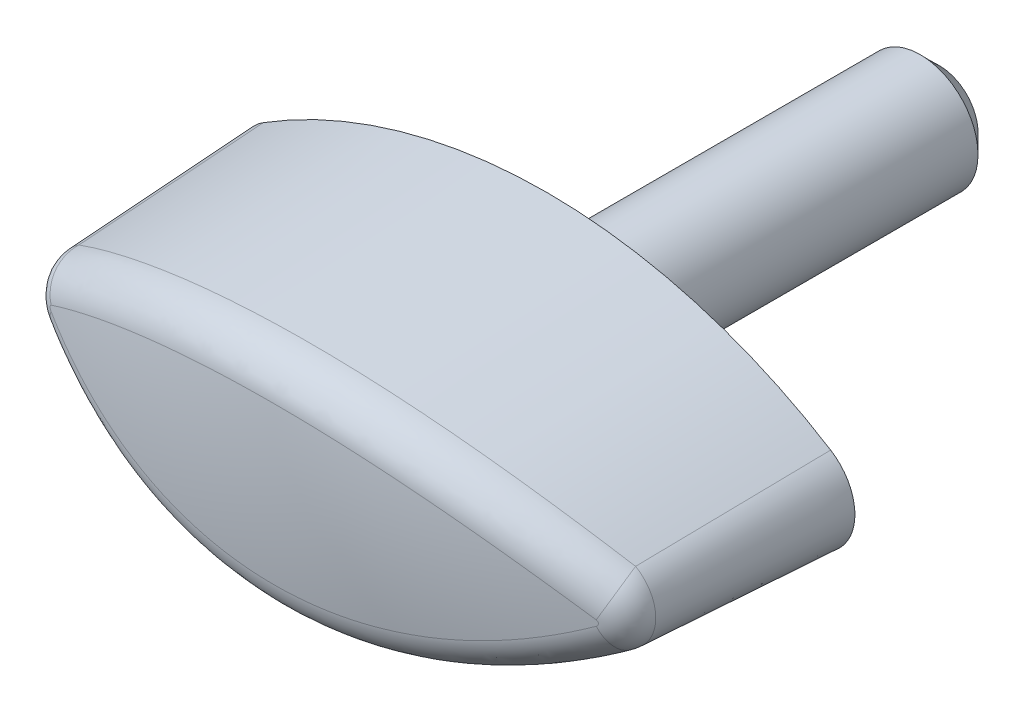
ISO-10303-21;
HEADER;
FILE_DESCRIPTION(('STEP AP214'),'2;1');
FILE_NAME('part.step','',(''),(''),'','','');
FILE_SCHEMA(('AUTOMOTIVE_DESIGN { 1 0 10303 214 1 1 1 1 }'));
ENDSEC;
DATA;
#1=APPLICATION_CONTEXT('core data for automotive mechanical design processes');
#2=APPLICATION_PROTOCOL_DEFINITION('international standard','automotive_design',2000,#1);
#3=PRODUCT_CONTEXT('',#1,'mechanical');
#4=PRODUCT('Part','Part','',(#3));
#5=PRODUCT_RELATED_PRODUCT_CATEGORY('part','',(#4));
#6=PRODUCT_DEFINITION_FORMATION('','',#4);
#7=PRODUCT_DEFINITION_CONTEXT('part definition',#1,'design');
#8=PRODUCT_DEFINITION('design','',#6,#7);
#9=PRODUCT_DEFINITION_SHAPE('','',#8);
#10=(LENGTH_UNIT() NAMED_UNIT(*) SI_UNIT(.MILLI.,.METRE.));
#11=(NAMED_UNIT(*) PLANE_ANGLE_UNIT() SI_UNIT($,.RADIAN.));
#12=(NAMED_UNIT(*) SI_UNIT($,.STERADIAN.) SOLID_ANGLE_UNIT());
#13=UNCERTAINTY_MEASURE_WITH_UNIT(LENGTH_MEASURE(1.E-05),#10,'distance_accuracy_value','');
#14=(GEOMETRIC_REPRESENTATION_CONTEXT(3) GLOBAL_UNCERTAINTY_ASSIGNED_CONTEXT((#13)) GLOBAL_UNIT_ASSIGNED_CONTEXT((#10,
#11,#12)) REPRESENTATION_CONTEXT('',''));
#15=CARTESIAN_POINT('',(0.,0.,0.));
#16=DIRECTION('',(0.,0.,1.));
#17=DIRECTION('',(1.,0.,0.));
#18=AXIS2_PLACEMENT_3D('',#15,#16,#17);
#19=CARTESIAN_POINT('',(0.,0.,0.));
#20=DIRECTION('',(0.,0.,1.));
#21=DIRECTION('',(1.,0.,0.));
#22=AXIS2_PLACEMENT_3D('',#19,#20,#21);
#23=PLANE('',#22);
#24=CARTESIAN_POINT('',(0.,0.,0.));
#25=DIRECTION('',(0.,0.,1.));
#26=DIRECTION('',(1.,0.,0.));
#27=AXIS2_PLACEMENT_3D('',#24,#25,#26);
#28=CIRCLE('',#27,4.);
#29=CARTESIAN_POINT('',(4.,0.,0.));
#30=VERTEX_POINT('',#29);
#31=EDGE_CURVE('E78',#30,#30,#28,.T.);
#32=ORIENTED_EDGE('',*,*,#31,.F.);
#33=EDGE_LOOP('',(#32));
#34=FACE_BOUND('',#33,.T.);
#35=CARTESIAN_POINT('',(0.,0.,0.));
#36=DIRECTION('',(0.,0.,1.));
#37=DIRECTION('',(1.,0.,0.));
#38=AXIS2_PLACEMENT_3D('',#35,#36,#37);
#39=CIRCLE('',#38,3.);
#40=CARTESIAN_POINT('',(3.,0.,0.));
#41=VERTEX_POINT('',#40);
#42=EDGE_CURVE('E242',#41,#41,#39,.F.);
#43=ORIENTED_EDGE('',*,*,#42,.F.);
#44=EDGE_LOOP('',(#43));
#45=FACE_BOUND('',#44,.T.);
#46=ADVANCED_FACE('F14',(#34,#45),#23,.F.);
#47=CARTESIAN_POINT('',(-13.3241500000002,0.,0.4));
#48=DIRECTION('',(0.,0.,-1.));
#49=DIRECTION('',(1.,0.,0.));
#50=AXIS2_PLACEMENT_3D('',#47,#48,#49);
#51=CONICAL_SURFACE('',#50,2.67585,0.05235987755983);
#52=DIRECTION('',(-0.0277995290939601,-0.0443422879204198,-0.998629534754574));
#53=VECTOR('',#52,1.);
#54=CARTESIAN_POINT('',(-14.7454934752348,-2.26714709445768,0.4));
#55=LINE('',#54,#53);
#56=CARTESIAN_POINT('',(-14.470842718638,-1.82905899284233,10.2661511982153));
#57=VERTEX_POINT('',#56);
#58=CARTESIAN_POINT('',(-14.7454934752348,-2.26714709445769,0.4));
#59=VERTEX_POINT('',#58);
#60=EDGE_CURVE('E69',#57,#59,#55,.T.);
#61=ORIENTED_EDGE('',*,*,#60,.F.);
#62=CARTESIAN_POINT('',(-14.1111522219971,-0.165958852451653,12.0353553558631));
#63=CARTESIAN_POINT('',(-14.3823216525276,-1.89767545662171,11.9165776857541));
#64=CARTESIAN_POINT('',(-13.7599471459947,-2.11317980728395,10.2878692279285));
#65=CARTESIAN_POINT('',(-14.1210125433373,-0.164146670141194,12.0313468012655));
#66=CARTESIAN_POINT('',(-14.4739846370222,-1.84166140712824,11.8795007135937));
#67=CARTESIAN_POINT('',(-13.8850154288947,-2.08766924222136,10.2840750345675));
#68=CARTESIAN_POINT('',(-14.1307383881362,-0.161437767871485,12.0273921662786));
#69=CARTESIAN_POINT('',(-14.560269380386,-1.77900246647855,11.8445972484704));
#70=CARTESIAN_POINT('',(-14.0079170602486,-2.05088202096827,10.2803318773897));
#71=CARTESIAN_POINT('',(-14.1496435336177,-0.154292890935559,12.0197038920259));
#72=CARTESIAN_POINT('',(-14.7199907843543,-1.6436778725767,11.779984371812));
#73=CARTESIAN_POINT('',(-14.2460605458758,-1.95582519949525,10.2730547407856));
#74=CARTESIAN_POINT('',(-14.15882204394,-0.149854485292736,12.015970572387));
#75=CARTESIAN_POINT('',(-14.7937592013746,-1.57105955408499,11.7501408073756));
#76=CARTESIAN_POINT('',(-14.3612913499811,-1.89752536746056,10.269521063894));
#77=CARTESIAN_POINT('',(-14.175595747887,-0.139761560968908,12.0091469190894));
#78=CARTESIAN_POINT('',(-14.9230565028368,-1.42425839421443,11.6978300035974));
#79=CARTESIAN_POINT('',(-14.5712596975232,-1.7663013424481,10.2630623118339));
#80=CARTESIAN_POINT('',(-14.183259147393,-0.134239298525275,12.0060289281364));
#81=CARTESIAN_POINT('',(-14.9797757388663,-1.35077369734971,11.6748814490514));
#82=CARTESIAN_POINT('',(-14.6669048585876,-1.69500184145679,10.2601110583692));
#83=CARTESIAN_POINT('',(-14.1976322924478,-0.121907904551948,12.0001802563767));
#84=CARTESIAN_POINT('',(-15.0827180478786,-1.19848356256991,11.633229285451));
#85=CARTESIAN_POINT('',(-14.8458739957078,-1.5367434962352,10.2545751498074));
#86=CARTESIAN_POINT('',(-14.2043429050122,-0.115099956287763,11.9974492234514));
#87=CARTESIAN_POINT('',(-15.1291674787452,-1.11960817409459,11.6144341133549));
#88=CARTESIAN_POINT('',(-14.9292091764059,-1.44979905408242,10.2519901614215));
#89=CARTESIAN_POINT('',(-14.2166059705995,-0.100314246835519,11.9924580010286));
#90=CARTESIAN_POINT('',(-15.2118238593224,-0.957298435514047,11.5809869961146));
#91=CARTESIAN_POINT('',(-15.0812034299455,-1.26176895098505,10.247265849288));
#92=CARTESIAN_POINT('',(-14.2221544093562,-0.0923325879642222,11.9901994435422));
#93=CARTESIAN_POINT('',(-15.2481840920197,-0.873720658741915,11.5662730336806));
#94=CARTESIAN_POINT('',(-15.1498116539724,-1.16063622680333,10.2451280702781));
#95=CARTESIAN_POINT('',(-14.2318417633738,-0.0754229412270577,11.9862557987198));
#96=CARTESIAN_POINT('',(-15.310410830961,-0.703304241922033,11.5410908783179));
#97=CARTESIAN_POINT('',(-15.2694263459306,-0.947014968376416,10.2413953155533));
#98=CARTESIAN_POINT('',(-14.2359807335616,-0.0664949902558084,11.9845706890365));
#99=CARTESIAN_POINT('',(-15.3364272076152,-0.616295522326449,11.5305620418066));
#100=CARTESIAN_POINT('',(-15.3204334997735,-0.834526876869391,10.2398003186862));
#101=CARTESIAN_POINT('',(-14.2424682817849,-0.0485036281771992,11.9819292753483));
#102=CARTESIAN_POINT('',(-15.3766810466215,-0.445231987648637,11.5142709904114));
#103=CARTESIAN_POINT('',(-15.4003125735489,-0.608271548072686,10.237300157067));
#104=CARTESIAN_POINT('',(-14.2449065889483,-0.0394779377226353,11.9809364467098));
#105=CARTESIAN_POINT('',(-15.3915978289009,-0.361143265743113,11.5082338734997));
#106=CARTESIAN_POINT('',(-15.4302943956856,-0.494954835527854,10.2363604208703));
#107=CARTESIAN_POINT('',(-14.2482592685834,-0.0211036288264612,11.9795712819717));
#108=CARTESIAN_POINT('',(-15.4119845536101,-0.192069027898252,11.4999829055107));
#109=CARTESIAN_POINT('',(-15.4715064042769,-0.264474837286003,10.2350682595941));
#110=CARTESIAN_POINT('',(-14.249174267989,-0.011755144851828,11.9791986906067));
#111=CARTESIAN_POINT('',(-15.4175053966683,-0.10689278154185,11.4977484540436));
#112=CARTESIAN_POINT('',(-15.4827443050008,-0.147313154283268,10.2347155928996));
#113=CARTESIAN_POINT('',(-14.2494335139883,0.00648408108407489,11.9790931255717));
#114=CARTESIAN_POINT('',(-15.4190697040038,0.058951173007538,11.4971153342));
#115=CARTESIAN_POINT('',(-15.485928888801,0.0812574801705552,10.2346156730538));
#116=CARTESIAN_POINT('',(-14.2488561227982,0.0153736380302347,11.9793282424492));
#117=CARTESIAN_POINT('',(-15.4155895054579,0.139798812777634,11.4985238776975));
#118=CARTESIAN_POINT('',(-15.4788379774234,0.192652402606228,10.2348382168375));
#119=CARTESIAN_POINT('',(-14.2463190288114,0.0329181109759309,11.9803613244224));
#120=CARTESIAN_POINT('',(-15.4002047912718,0.300526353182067,11.5047504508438));
#121=CARTESIAN_POINT('',(-15.4476586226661,0.412646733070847,10.235816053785));
#122=CARTESIAN_POINT('',(-14.2443595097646,0.0415730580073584,11.9811592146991));
#123=CARTESIAN_POINT('',(-15.3882693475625,0.380571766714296,11.509580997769));
#124=CARTESIAN_POINT('',(-15.4235724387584,0.521246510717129,10.2365712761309));
#125=CARTESIAN_POINT('',(-14.2391494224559,0.0583683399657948,11.9832805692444));
#126=CARTESIAN_POINT('',(-15.3561638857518,0.538484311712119,11.5225744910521));
#127=CARTESIAN_POINT('',(-15.3594579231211,0.732277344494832,10.238579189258));
#128=CARTESIAN_POINT('',(-14.2359051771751,0.066510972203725,11.9846014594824));
#129=CARTESIAN_POINT('',(-15.3359693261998,0.616511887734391,11.5307473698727));
#130=CARTESIAN_POINT('',(-15.3195076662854,0.834735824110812,10.2398294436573));
#131=CARTESIAN_POINT('',(-14.2282440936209,0.0821264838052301,11.9877204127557));
#132=CARTESIAN_POINT('',(-15.2874641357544,0.770070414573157,11.5503771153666));
#133=CARTESIAN_POINT('',(-15.2250224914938,1.0316320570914,10.2427816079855));
#134=CARTESIAN_POINT('',(-14.2238268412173,0.0895991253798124,11.9895186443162));
#135=CARTESIAN_POINT('',(-15.2590568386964,0.845729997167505,11.5618730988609));
#136=CARTESIAN_POINT('',(-15.1704824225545,1.12606696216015,10.2444836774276));
#137=CARTESIAN_POINT('',(-14.2137612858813,0.104002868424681,11.9936158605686));
#138=CARTESIAN_POINT('',(-15.1928617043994,0.99695391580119,11.5886601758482));
#139=CARTESIAN_POINT('',(-15.0459668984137,1.30860670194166,10.2483617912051));
#140=CARTESIAN_POINT('',(-14.2080691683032,0.110898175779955,11.9959326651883));
#141=CARTESIAN_POINT('',(-15.1546094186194,1.07247135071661,11.6041391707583));
#142=CARTESIAN_POINT('',(-14.9754405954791,1.39628070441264,10.2505547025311));
#143=CARTESIAN_POINT('',(-14.1957613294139,0.123631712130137,12.0009416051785));
#144=CARTESIAN_POINT('',(-15.0694987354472,1.21914960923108,11.638578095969));
#145=CARTESIAN_POINT('',(-14.8225909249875,1.55881794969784,10.2552957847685));
#146=CARTESIAN_POINT('',(-14.1891467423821,0.129471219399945,12.0036332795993));
#147=CARTESIAN_POINT('',(-15.0224895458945,1.29040002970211,11.6575990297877));
#148=CARTESIAN_POINT('',(-14.7402820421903,1.63369667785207,10.2578435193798));
#149=CARTESIAN_POINT('',(-14.1773697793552,0.138352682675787,12.0084250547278));
#150=CARTESIAN_POINT('',(-14.9360880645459,1.40603579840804,11.6925572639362));
#151=CARTESIAN_POINT('',(-14.5933599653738,1.74816987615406,10.2623790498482));
#152=CARTESIAN_POINT('',(-14.1724000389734,0.141698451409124,12.0104469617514));
#153=CARTESIAN_POINT('',(-14.8987295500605,1.45201881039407,11.7076721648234));
#154=CARTESIAN_POINT('',(-14.5312610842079,1.79147617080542,10.2642928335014));
#155=CARTESIAN_POINT('',(-14.1585614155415,0.149986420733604,12.0160765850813));
#156=CARTESIAN_POINT('',(-14.7916892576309,1.57315694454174,11.7509782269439));
#157=CARTESIAN_POINT('',(-14.358021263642,1.8992545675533,10.2696214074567));
#158=CARTESIAN_POINT('',(-14.1494117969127,0.15439310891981,12.019798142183));
#159=CARTESIAN_POINT('',(-14.7180908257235,1.64542185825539,11.7807529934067));
#160=CARTESIAN_POINT('',(-14.2431465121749,1.95714897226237,10.2731439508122));
#161=CARTESIAN_POINT('',(-14.1304899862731,0.161518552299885,12.0274931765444));
#162=CARTESIAN_POINT('',(-14.5581071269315,1.7806938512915,11.8454719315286));
#163=CARTESIAN_POINT('',(-14.0047825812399,2.05196680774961,10.2804274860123));
#164=CARTESIAN_POINT('',(-14.120713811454,0.164225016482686,12.0314682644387));
#165=CARTESIAN_POINT('',(-14.4712934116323,1.84355858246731,11.8805893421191));
#166=CARTESIAN_POINT('',(-13.8812376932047,2.08873737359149,10.2841900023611));
#167=CARTESIAN_POINT('',(-14.1108098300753,0.16602164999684,12.0354945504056));
#168=CARTESIAN_POINT('',(-14.3791069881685,1.8996354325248,11.9178779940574));
#169=CARTESIAN_POINT('',(-13.7556046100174,2.11406366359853,10.2880009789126));
#170=(BOUNDED_SURFACE() B_SPLINE_SURFACE(3,2,((#62,#63,#64),(#65,#66,#67),(#68,#69,#70),(#71,
#72,#73),(#74,#75,#76),(#77,#78,#79),(#80,#81,#82),(#83,#84,#85),(#86,#87,#88),(#89,#90,#91),
(#92,#93,#94),(#95,#96,#97),(#98,#99,#100),(#101,#102,#103),(#104,#105,#106),(#107,#108,#109),
(#110,#111,#112),(#113,#114,#115),(#116,#117,#118),(#119,#120,#121),(#122,#123,#124),(#125,#126,
#127),(#128,#129,#130),(#131,#132,#133),(#134,#135,#136),(#137,#138,#139),(#140,#141,#142),
(#143,#144,#145),(#146,#147,#148),(#149,#150,#151),(#152,#153,#154),(#155,#156,#157),(#158,#159,
#160),(#161,#162,#163),(#164,#165,#166),(#167,#168,#169)),.UNSPECIFIED.,.F.,.F.,
.F.) B_SPLINE_SURFACE_WITH_KNOTS((4,2,2,2,2,2,2,2,2,2,2,2,2,2,2,2,2,4),(3,3),(0.,
0.0306369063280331,0.0613170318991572,0.0894390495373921,0.117535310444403,0.145727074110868,
0.173917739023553,0.200477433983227,0.227026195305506,0.252209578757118,0.277389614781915,
0.30244723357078,0.327513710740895,0.353630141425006,0.379714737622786,0.397643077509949,
0.428199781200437,0.458974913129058),(0.,1.),
.UNSPECIFIED.) GEOMETRIC_REPRESENTATION_ITEM() RATIONAL_B_SPLINE_SURFACE(((1.,0.75130211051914,
1.),(1.,0.758551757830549,1.),(1.,0.765564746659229,1.),(1.,0.77898188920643,1.),(1.,
0.78538517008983,1.),(1.,0.796924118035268,1.),(1.,0.80212096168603,1.),(1.,0.811762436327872,
1.),(1.,0.816207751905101,1.),(1.,0.824260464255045,1.),(1.,0.827864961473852,1.),(1.,
0.834118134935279,1.),(1.,0.836766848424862,1.),(1.,0.840902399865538,1.),(1.,0.842447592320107,
1.),(1.,0.844569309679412,1.),(1.,0.84514623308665,1.),(1.,0.845309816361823,1.),(1.,
0.844945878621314,1.),(1.,0.843341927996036,1.),(1.,0.842102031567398,1.),(1.,0.838788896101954,
1.),(1.,0.836719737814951,1.),(1.,0.831800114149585,1.),(1.,0.828949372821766,1.),(1.,
0.822397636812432,1.),(1.,0.818666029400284,1.),(1.,0.810510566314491,1.),(1.,0.806087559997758,
1.),(1.,0.79811623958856,1.),(1.,0.794726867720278,1.),(1.,0.785203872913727,1.),(1.,
0.778818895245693,1.),(1.,0.765386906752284,1.),(1.,0.758335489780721,1.),(1.,0.751050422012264,1.))) REPRESENTATION_ITEM('') SURFACE());
#171=CARTESIAN_POINT('',(-13.7599471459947,-2.11317980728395,10.2878692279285));
#172=CARTESIAN_POINT('',(-13.8850154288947,-2.08766924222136,10.2840750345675));
#173=CARTESIAN_POINT('',(-14.0079170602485,-2.05088202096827,10.2803318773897));
#174=CARTESIAN_POINT('',(-14.2460605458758,-1.95582519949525,10.2730547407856));
#175=CARTESIAN_POINT('',(-14.3612913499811,-1.89752536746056,10.269521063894));
#176=CARTESIAN_POINT('',(-14.5712596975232,-1.7663013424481,10.2630623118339));
#177=CARTESIAN_POINT('',(-14.6669048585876,-1.69500184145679,10.2601110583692));
#178=CARTESIAN_POINT('',(-14.8458739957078,-1.5367434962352,10.2545751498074));
#179=CARTESIAN_POINT('',(-14.9292091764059,-1.44979905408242,10.2519901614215));
#180=CARTESIAN_POINT('',(-15.0812034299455,-1.26176895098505,10.247265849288));
#181=CARTESIAN_POINT('',(-15.1498116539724,-1.16063622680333,10.2451280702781));
#182=CARTESIAN_POINT('',(-15.2694263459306,-0.947014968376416,10.2413953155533));
#183=CARTESIAN_POINT('',(-15.3204334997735,-0.834526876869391,10.2398003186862));
#184=CARTESIAN_POINT('',(-15.4003125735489,-0.608271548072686,10.237300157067));
#185=CARTESIAN_POINT('',(-15.4302943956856,-0.494954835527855,10.2363604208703));
#186=CARTESIAN_POINT('',(-15.4715064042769,-0.264474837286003,10.2350682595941));
#187=CARTESIAN_POINT('',(-15.4827443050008,-0.147313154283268,10.2347155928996));
#188=CARTESIAN_POINT('',(-15.485928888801,0.0812574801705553,10.2346156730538));
#189=CARTESIAN_POINT('',(-15.4788379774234,0.192652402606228,10.2348382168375));
#190=CARTESIAN_POINT('',(-15.4476586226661,0.412646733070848,10.235816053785));
#191=CARTESIAN_POINT('',(-15.4235724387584,0.521246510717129,10.2365712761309));
#192=CARTESIAN_POINT('',(-15.3594579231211,0.732277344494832,10.238579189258));
#193=CARTESIAN_POINT('',(-15.3195076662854,0.834735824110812,10.2398294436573));
#194=CARTESIAN_POINT('',(-15.2250224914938,1.0316320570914,10.2427816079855));
#195=CARTESIAN_POINT('',(-15.1704824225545,1.12606696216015,10.2444836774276));
#196=CARTESIAN_POINT('',(-15.0459668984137,1.30860670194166,10.2483617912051));
#197=CARTESIAN_POINT('',(-14.9754405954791,1.39628070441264,10.2505547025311));
#198=CARTESIAN_POINT('',(-14.8225909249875,1.55881794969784,10.2552957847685));
#199=CARTESIAN_POINT('',(-14.7402820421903,1.63369667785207,10.2578435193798));
#200=CARTESIAN_POINT('',(-14.5933599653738,1.74816987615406,10.2623790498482));
#201=CARTESIAN_POINT('',(-14.5312610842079,1.79147617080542,10.2642928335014));
#202=CARTESIAN_POINT('',(-14.358021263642,1.8992545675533,10.2696214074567));
#203=CARTESIAN_POINT('',(-14.2431465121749,1.95714897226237,10.2731439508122));
#204=CARTESIAN_POINT('',(-14.0047825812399,2.05196680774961,10.2804274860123));
#205=CARTESIAN_POINT('',(-13.8812376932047,2.08873737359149,10.2841900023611));
#206=CARTESIAN_POINT('',(-13.7556046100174,2.11406366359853,10.2880009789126));
#207=B_SPLINE_CURVE_WITH_KNOTS('',3,(#171,#172,#173,#174,#175,#176,#177,#178,#179,#180,#181,
#182,#183,#184,#185,#186,#187,#188,#189,#190,#191,#192,#193,#194,#195,#196,#197,#198,#199,#200,
#201,#202,#203,#204,#205,#206),.UNSPECIFIED.,.F.,.F.,(4,2,2,2,2,2,2,2,2,2,2,2,2,2,2,2,2,4),(0.,
0.0306369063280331,0.0613170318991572,0.0894390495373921,0.117535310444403,0.145727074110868,
0.173917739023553,0.200477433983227,0.227026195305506,0.252209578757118,0.277389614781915,
0.30244723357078,0.327513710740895,0.353630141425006,0.379714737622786,0.397643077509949,
0.428199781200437,0.458974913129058),.UNSPECIFIED.);
#208=CARTESIAN_POINT('',(-14.4672021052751,1.83132944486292,10.266263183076));
#209=VERTEX_POINT('',#208);
#210=EDGE_CURVE('E38',#57,#209,#207,.T.);
#211=ORIENTED_EDGE('',*,*,#210,.T.);
#212=DIRECTION('',(-0.0277113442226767,0.044397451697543,-0.998629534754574));
#213=VECTOR('',#212,1.);
#214=CARTESIAN_POINT('',(-14.740984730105,2.2699675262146,0.4));
#215=LINE('',#214,#213);
#216=CARTESIAN_POINT('',(-14.740984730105,2.26996752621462,0.4));
#217=VERTEX_POINT('',#216);
#218=EDGE_CURVE('E91',#209,#217,#215,.T.);
#219=ORIENTED_EDGE('',*,*,#218,.T.);
#220=CARTESIAN_POINT('',(-13.3241500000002,0.,0.4));
#221=DIRECTION('',(0.,0.,1.));
#222=DIRECTION('',(1.,0.,0.));
#223=AXIS2_PLACEMENT_3D('',#220,#221,#222);
#224=CIRCLE('',#223,2.67585);
#225=EDGE_CURVE('E86',#217,#59,#224,.T.);
#226=ORIENTED_EDGE('',*,*,#225,.T.);
#227=EDGE_LOOP('',(#61,#211,#219,#226));
#228=FACE_BOUND('',#227,.T.);
#229=ADVANCED_FACE('F90',(#228),#51,.T.);
#230=CARTESIAN_POINT('',(0.,21.2529965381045,0.4));
#231=DIRECTION('',(0.,0.,-1.));
#232=DIRECTION('',(1.,0.,0.));
#233=AXIS2_PLACEMENT_3D('',#230,#231,#232);
#234=CONICAL_SURFACE('',#233,27.7601645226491,0.05235987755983);
#235=DIRECTION('',(0.0277995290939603,-0.0443422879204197,-0.998629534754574));
#236=VECTOR('',#235,1.);
#237=CARTESIAN_POINT('',(14.7454934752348,-2.2671470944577,0.4));
#238=LINE('',#237,#236);
#239=CARTESIAN_POINT('',(14.4708427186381,-1.82905899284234,10.2661511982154));
#240=VERTEX_POINT('',#239);
#241=CARTESIAN_POINT('',(14.7454934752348,-2.2671470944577,0.4));
#242=VERTEX_POINT('',#241);
#243=EDGE_CURVE('E79',#240,#242,#238,.T.);
#244=ORIENTED_EDGE('',*,*,#243,.F.);
#245=CARTESIAN_POINT('',(20.9050060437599,5.54532875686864,7.9121295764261));
#246=CARTESIAN_POINT('',(21.7174475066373,4.55531908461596,7.53542153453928));
#247=CARTESIAN_POINT('',(21.3399844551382,3.99277493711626,6.38513680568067));
#248=CARTESIAN_POINT('',(20.6760760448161,5.27938420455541,8.11731061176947));
#249=CARTESIAN_POINT('',(21.4880466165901,4.27500771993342,7.74353533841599));
#250=CARTESIAN_POINT('',(21.1069121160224,3.72079448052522,6.57934559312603));
#251=CARTESIAN_POINT('',(20.4406185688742,5.01594720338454,8.31838499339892));
#252=CARTESIAN_POINT('',(21.2520919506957,3.99758864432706,7.94725170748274));
#253=CARTESIAN_POINT('',(20.8671443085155,3.45135943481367,6.76966733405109));
#254=CARTESIAN_POINT('',(19.9566154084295,4.49488377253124,8.71221504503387));
#255=CARTESIAN_POINT('',(20.7660305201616,3.44806434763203,8.34676773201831));
#256=CARTESIAN_POINT('',(20.3741824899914,2.9183968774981,7.14243695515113));
#257=CARTESIAN_POINT('',(19.7080684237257,4.23725792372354,8.90496988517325));
#258=CARTESIAN_POINT('',(20.515875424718,3.17600018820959,8.54251933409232));
#259=CARTESIAN_POINT('',(20.1209871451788,2.6548699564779,7.32488404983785));
#260=CARTESIAN_POINT('',(18.94245673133,3.47401354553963,9.47080065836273));
#261=CARTESIAN_POINT('',(19.7420383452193,2.3670337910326,9.11914619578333));
#262=CARTESIAN_POINT('',(19.3409148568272,1.87409331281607,7.86045649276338));
#263=CARTESIAN_POINT('',(18.4057415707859,2.97840260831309,9.83115538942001));
#264=CARTESIAN_POINT('',(19.198409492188,1.84154871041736,9.48630048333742));
#265=CARTESIAN_POINT('',(18.7938777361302,1.36703064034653,8.20154091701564));
#266=CARTESIAN_POINT('',(17.2801500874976,2.02006402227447,10.5170899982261));
#267=CARTESIAN_POINT('',(18.0538112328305,0.822138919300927,10.187243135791));
#268=CARTESIAN_POINT('',(17.6462833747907,0.38643701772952,8.85079453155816));
#269=CARTESIAN_POINT('',(16.6911440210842,1.55742360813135,10.8425786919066));
#270=CARTESIAN_POINT('',(17.4525055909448,0.328829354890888,10.5204794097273));
#271=CARTESIAN_POINT('',(17.0455929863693,-0.0870049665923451,9.15887741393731));
#272=CARTESIAN_POINT('',(15.4647399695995,0.673629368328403,11.4560252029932));
#273=CARTESIAN_POINT('',(16.1957186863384,-0.616703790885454,11.150442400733));
#274=CARTESIAN_POINT('',(15.7945383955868,-0.991524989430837,9.73951929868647));
#275=CARTESIAN_POINT('',(14.8273638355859,0.252457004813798,11.7439998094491));
#276=CARTESIAN_POINT('',(15.5402190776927,-1.06832180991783,11.4466965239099));
#277=CARTESIAN_POINT('',(15.1441966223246,-1.42262195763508,10.0120941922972));
#278=CARTESIAN_POINT('',(13.6144082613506,-0.477469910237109,12.2374446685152));
#279=CARTESIAN_POINT('',(14.2889658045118,-1.85317589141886,11.95558717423));
#280=CARTESIAN_POINT('',(13.9063053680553,-2.16981425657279,10.4791516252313));
#281=CARTESIAN_POINT('',(13.0454878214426,-0.793392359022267,12.4487272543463));
#282=CARTESIAN_POINT('',(13.7001600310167,-2.19368449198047,12.1739252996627));
#283=CARTESIAN_POINT('',(13.325592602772,-2.49323585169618,10.6791356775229));
#284=CARTESIAN_POINT('',(11.8788560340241,-1.38752516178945,12.8428373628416));
#285=CARTESIAN_POINT('',(12.4893007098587,-2.83576538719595,12.5821905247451));
#286=CARTESIAN_POINT('',(12.1346036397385,-3.10151067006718,11.0521703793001));
#287=CARTESIAN_POINT('',(11.281148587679,-1.66574060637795,13.0256687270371));
#288=CARTESIAN_POINT('',(11.8674609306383,-3.13691358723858,12.771827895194));
#289=CARTESIAN_POINT('',(11.5243314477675,-3.38636909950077,11.2252246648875));
#290=CARTESIAN_POINT('',(10.0612672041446,-2.18050261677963,13.3616744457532));
#291=CARTESIAN_POINT('',(10.5949943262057,-3.6955197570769,13.1211546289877));
#292=CARTESIAN_POINT('',(10.2786549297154,-3.91345047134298,11.5432621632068));
#293=CARTESIAN_POINT('',(9.43913707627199,-2.41711996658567,13.5148992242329));
#294=CARTESIAN_POINT('',(9.94474128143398,-3.95263187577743,13.2806192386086));
#295=CARTESIAN_POINT('',(9.64329559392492,-4.15574583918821,11.6882931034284));
#296=CARTESIAN_POINT('',(8.17328674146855,-2.84614618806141,13.7912422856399));
#297=CARTESIAN_POINT('',(8.61856304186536,-4.41991057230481,13.5688401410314));
#298=CARTESIAN_POINT('',(8.3504024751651,-4.59508619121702,11.9498584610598));
#299=CARTESIAN_POINT('',(7.52956656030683,-3.03855511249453,13.9143606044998));
#300=CARTESIAN_POINT('',(7.94308247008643,-4.62968572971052,13.6973476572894));
#301=CARTESIAN_POINT('',(7.69286871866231,-4.79213122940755,12.0663929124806));
#302=CARTESIAN_POINT('',(6.22276774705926,-3.37707024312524,14.1301139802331));
#303=CARTESIAN_POINT('',(6.56904081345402,-4.99952533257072,13.9229853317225));
#304=CARTESIAN_POINT('',(6.35792888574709,-5.13881412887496,12.2706086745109));
#305=CARTESIAN_POINT('',(5.55963336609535,-3.52302508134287,14.222649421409));
#306=CARTESIAN_POINT('',(5.87097647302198,-5.15908700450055,14.0198018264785));
#307=CARTESIAN_POINT('',(5.68046554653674,-5.28829701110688,12.3581956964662));
#308=CARTESIAN_POINT('',(4.22079235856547,-3.76571142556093,14.376114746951));
#309=CARTESIAN_POINT('',(4.4593178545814,-5.4248682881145,14.1806368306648));
#310=CARTESIAN_POINT('',(4.31262439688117,-5.53685491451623,12.5034543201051));
#311=CARTESIAN_POINT('',(3.54508559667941,-3.86244240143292,14.4370442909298));
#312=CARTESIAN_POINT('',(3.74637181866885,-5.53082904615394,14.2444974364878));
#313=CARTESIAN_POINT('',(3.6222464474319,-5.63592939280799,12.561125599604));
#314=CARTESIAN_POINT('',(2.18579315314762,-4.00532107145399,14.5269316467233));
#315=CARTESIAN_POINT('',(2.31046020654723,-5.68755977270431,14.3388364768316));
#316=CARTESIAN_POINT('',(2.23339915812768,-5.7822710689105,12.6462061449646));
#317=CARTESIAN_POINT('',(1.50220274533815,-4.05143663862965,14.5558691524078));
#318=CARTESIAN_POINT('',(1.58820308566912,-5.7381359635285,14.369197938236));
#319=CARTESIAN_POINT('',(1.53492496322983,-5.82950536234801,12.6735961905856));
#320=CARTESIAN_POINT('',(0.132902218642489,-4.09229415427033,14.5815109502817));
#321=CARTESIAN_POINT('',(0.140416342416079,-5.78299001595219,14.396128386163));
#322=CARTESIAN_POINT('',(0.135798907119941,-5.87135399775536,12.6978667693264));
#323=CARTESIAN_POINT('',(-0.552807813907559,-4.08703816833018,14.5782165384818));
#324=CARTESIAN_POINT('',(-0.584367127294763,-5.77722387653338,14.3926709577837));
#325=CARTESIAN_POINT('',(-0.56485286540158,-5.8659704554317,12.6947485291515));
#326=CARTESIAN_POINT('',(-1.89394621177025,-4.02646090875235,14.5401880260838));
#327=CARTESIAN_POINT('',(-2.00224881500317,-5.71072593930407,14.3527337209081));
#328=CARTESIAN_POINT('',(-1.93519747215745,-5.80392386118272,12.6587536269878));
#329=CARTESIAN_POINT('',(-2.54950092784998,-3.97312519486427,14.5067007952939));
#330=CARTESIAN_POINT('',(-2.69477989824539,-5.65223744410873,14.3176016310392));
#331=CARTESIAN_POINT('',(-2.60502009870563,-5.74929452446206,12.6270571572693));
#332=CARTESIAN_POINT('',(-3.85294450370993,-3.8198674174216,14.4102200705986));
#333=CARTESIAN_POINT('',(-4.07135869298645,-5.48415724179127,14.2163617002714));
#334=CARTESIAN_POINT('',(-3.93679047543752,-5.59232303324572,12.5357358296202));
#335=CARTESIAN_POINT('',(-4.50083331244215,-3.71994504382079,14.3472263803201));
#336=CARTESIAN_POINT('',(-4.75478134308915,-5.37472133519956,14.150347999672));
#337=CARTESIAN_POINT('',(-4.59873817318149,-5.48998056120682,12.4761107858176));
#338=CARTESIAN_POINT('',(-5.7838363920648,-3.47495260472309,14.1921729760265));
#339=CARTESIAN_POINT('',(-6.10715893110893,-5.10648464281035,13.9878860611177));
#340=CARTESIAN_POINT('',(-5.90951464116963,-5.23906249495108,12.3293490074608));
#341=CARTESIAN_POINT('',(-6.41896223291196,-3.32992559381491,14.1001409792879));
#342=CARTESIAN_POINT('',(-6.77556008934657,-4.94797002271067,13.8916129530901));
#343=CARTESIAN_POINT('',(-6.55835529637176,-5.09053099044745,12.2422385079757));
#344=CARTESIAN_POINT('',(-7.67269500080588,-2.99665755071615,13.887559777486));
#345=CARTESIAN_POINT('',(-8.09342362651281,-4.58395230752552,13.6693403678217));
#346=CARTESIAN_POINT('',(-7.83907014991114,-4.74922402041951,12.0410252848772));
#347=CARTESIAN_POINT('',(-8.29130409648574,-2.80842222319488,13.7670143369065));
#348=CARTESIAN_POINT('',(-8.74240334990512,-4.37876017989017,13.5435342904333));
#349=CARTESIAN_POINT('',(-8.47094657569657,-4.55645439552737,11.9269261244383));
#350=CARTESIAN_POINT('',(-9.83278621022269,-2.27973915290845,13.426286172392));
#351=CARTESIAN_POINT('',(-10.3553075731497,-3.80366082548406,13.1886003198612));
#352=CARTESIAN_POINT('',(-10.0453448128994,-4.015063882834,11.6044187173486));
#353=CARTESIAN_POINT('',(-10.7421972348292,-1.91162341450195,13.187233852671));
#354=CARTESIAN_POINT('',(-11.3043510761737,-3.40434408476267,12.9402193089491));
#355=CARTESIAN_POINT('',(-10.9740391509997,-3.63812328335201,11.3781499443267));
#356=CARTESIAN_POINT('',(-12.5017898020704,-1.08947558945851,12.6462122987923));
#357=CARTESIAN_POINT('',(-13.1351357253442,-2.51404099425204,12.3787755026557));
#358=CARTESIAN_POINT('',(-12.7706034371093,-2.79635357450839,10.8660600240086));
#359=CARTESIAN_POINT('',(-13.3519400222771,-0.635398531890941,12.3442101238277));
#360=CARTESIAN_POINT('',(-14.0159911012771,-2.02438542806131,12.0666016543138));
#361=CARTESIAN_POINT('',(-13.6384412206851,-2.33147846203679,10.5802076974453));
#362=CARTESIAN_POINT('',(-14.826173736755,0.251726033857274,11.7444918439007));
#363=CARTESIAN_POINT('',(-15.5389898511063,-1.06910489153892,11.4472009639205));
#364=CARTESIAN_POINT('',(-15.1429821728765,-1.42337021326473,10.0125599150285));
#365=CARTESIAN_POINT('',(-15.4622686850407,0.671990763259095,11.4571450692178));
#366=CARTESIAN_POINT('',(-16.1931839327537,-0.618454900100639,11.151590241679));
#367=CARTESIAN_POINT('',(-15.7920168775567,-0.993202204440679,9.74057927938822));
#368=CARTESIAN_POINT('',(-16.6865483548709,1.55397020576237,10.8449931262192));
#369=CARTESIAN_POINT('',(-17.4478169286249,0.325148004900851,10.5229507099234));
#370=CARTESIAN_POINT('',(-17.0409055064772,-0.0905391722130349,9.16116273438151));
#371=CARTESIAN_POINT('',(-17.2746998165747,2.01571323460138,10.5201623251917));
#372=CARTESIAN_POINT('',(-18.0482607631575,0.817508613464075,10.1903830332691));
#373=CARTESIAN_POINT('',(-17.640725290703,0.381984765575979,8.85370256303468));
#374=CARTESIAN_POINT('',(-18.4008102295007,2.97391732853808,9.83440708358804));
#375=CARTESIAN_POINT('',(-19.193401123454,1.83678082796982,9.48962193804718));
#376=CARTESIAN_POINT('',(-18.7888512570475,1.36244162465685,8.20461872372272));
#377=CARTESIAN_POINT('',(-18.9387119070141,3.47041690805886,9.47344240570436));
#378=CARTESIAN_POINT('',(-19.7382446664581,2.36321569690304,9.12184197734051));
#379=CARTESIAN_POINT('',(-19.3370986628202,1.87041382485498,7.86295697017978));
#380=CARTESIAN_POINT('',(-19.7058984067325,4.23502684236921,8.90663609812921));
#381=CARTESIAN_POINT('',(-20.5136886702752,3.17364131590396,8.54421339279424));
#382=CARTESIAN_POINT('',(-20.1187764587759,2.65258774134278,7.32646116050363));
#383=CARTESIAN_POINT('',(-19.954910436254,4.49308322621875,8.71356907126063));
#384=CARTESIAN_POINT('',(-20.7643146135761,3.44616207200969,8.34814360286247));
#385=CARTESIAN_POINT('',(-20.3724457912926,2.91655515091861,7.14371857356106));
#386=CARTESIAN_POINT('',(-20.439799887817,5.0150310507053,8.31908426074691));
#387=CARTESIAN_POINT('',(-21.2512696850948,3.99662171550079,7.94796173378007));
#388=CARTESIAN_POINT('',(-20.8663106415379,3.4504224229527,6.77032920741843));
#389=CARTESIAN_POINT('',(-20.6756785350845,5.27892194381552,8.11766725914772));
#390=CARTESIAN_POINT('',(-21.4876473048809,4.27451935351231,7.74389790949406));
#391=CARTESIAN_POINT('',(-21.1065074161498,3.72032172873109,6.57968316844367));
#392=CARTESIAN_POINT('',(-20.9050060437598,5.54532875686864,7.91212957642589));
#393=CARTESIAN_POINT('',(-21.7174475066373,4.55531908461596,7.53542153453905));
#394=CARTESIAN_POINT('',(-21.3399844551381,3.99277493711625,6.38513680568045));
#395=(BOUNDED_SURFACE() B_SPLINE_SURFACE(3,2,((#245,#246,#247),(#248,#249,#250),(#251,#252,
#253),(#254,#255,#256),(#257,#258,#259),(#260,#261,#262),(#263,#264,#265),(#266,#267,#268),
(#269,#270,#271),(#272,#273,#274),(#275,#276,#277),(#278,#279,#280),(#281,#282,#283),(#284,#285,
#286),(#287,#288,#289),(#290,#291,#292),(#293,#294,#295),(#296,#297,#298),(#299,#300,#301),
(#302,#303,#304),(#305,#306,#307),(#308,#309,#310),(#311,#312,#313),(#314,#315,#316),(#317,#318,
#319),(#320,#321,#322),(#323,#324,#325),(#326,#327,#328),(#329,#330,#331),(#332,#333,#334),
(#335,#336,#337),(#338,#339,#340),(#341,#342,#343),(#344,#345,#346),(#347,#348,#349),(#350,#351,
#352),(#353,#354,#355),(#356,#357,#358),(#359,#360,#361),(#362,#363,#364),(#365,#366,#367),
(#368,#369,#370),(#371,#372,#373),(#374,#375,#376),(#377,#378,#379),(#380,#381,#382),(#383,#384,
#385),(#386,#387,#388),(#389,#390,#391),(#392,#393,#394)),.UNSPECIFIED.,.F.,.F.,
.F.) B_SPLINE_SURFACE_WITH_KNOTS((4,2,2,2,2,2,2,2,2,2,2,2,2,2,2,2,2,2,2,2,2,2,2,2,4),(3,3),(0.,
1.15410504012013,2.30832493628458,4.61837958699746,6.93433528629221,9.2492509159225,
11.1900673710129,13.1306215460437,15.0678409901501,17.005058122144,18.948524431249,
20.8920116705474,22.8367317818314,24.7813736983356,26.649210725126,28.5170601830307,
30.3831321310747,32.2489578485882,35.1087148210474,37.969972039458,40.2803521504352,
42.5923216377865,44.9068949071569,46.0631146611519,47.2192263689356),(0.,1.),
.UNSPECIFIED.) GEOMETRIC_REPRESENTATION_ITEM() RATIONAL_B_SPLINE_SURFACE(((1.,0.831740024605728,
1.),(1.,0.829912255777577,1.),(1.,0.828093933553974,1.),(1.,0.824482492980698,1.),(1.,
0.822689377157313,1.),(1.,0.817355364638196,1.),(1.,0.813862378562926,1.),(1.,0.807056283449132,
1.),(1.,0.803743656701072,1.),(1.,0.797370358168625,1.),(1.,0.794309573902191,1.),(1.,
0.788970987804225,1.),(1.,0.786646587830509,1.),(1.,0.782254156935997,1.),(1.,0.780186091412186,
1.),(1.,0.776343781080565,1.),(1.,0.774569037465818,1.),(1.,0.771340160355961,1.),(1.,
0.769886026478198,1.),(1.,0.767321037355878,1.),(1.,0.766211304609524,1.),(1.,0.764362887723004,
1.),(1.,0.763624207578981,1.),(1.,0.762532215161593,1.),(1.,0.762179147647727,1.),(1.,
0.761866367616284,1.),(1.,0.761906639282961,1.),(1.,0.762370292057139,1.),(1.,0.762778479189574,
1.),(1.,0.763949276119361,1.),(1.,0.764711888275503,1.),(1.,0.766576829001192,1.),(1.,
0.767678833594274,1.),(1.,0.77020274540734,1.),(1.,0.771624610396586,1.),(1.,0.775602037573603,
1.),(1.,0.778358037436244,1.),(1.,0.784464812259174,1.),(1.,0.787815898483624,1.),(1.,
0.794304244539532,1.),(1.,0.797358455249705,1.),(1.,0.803718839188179,1.),(1.,0.80702518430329,
1.),(1.,0.813830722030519,1.),(1.,0.81733012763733,1.),(1.,0.822673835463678,1.),(1.,
0.824469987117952,1.),(1.,0.828087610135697,1.),(1.,0.829909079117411,1.),(1.,0.83174002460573,1.))) REPRESENTATION_ITEM('') SURFACE());
#396=CARTESIAN_POINT('',(21.3399844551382,3.99277493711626,6.38513680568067));
#397=CARTESIAN_POINT('',(21.1069121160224,3.72079448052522,6.57934559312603));
#398=CARTESIAN_POINT('',(20.8671443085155,3.45135943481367,6.76966733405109));
#399=CARTESIAN_POINT('',(20.3741824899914,2.9183968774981,7.14243695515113));
#400=CARTESIAN_POINT('',(20.1209871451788,2.6548699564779,7.32488404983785));
#401=CARTESIAN_POINT('',(19.3409148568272,1.87409331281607,7.86045649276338));
#402=CARTESIAN_POINT('',(18.7938777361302,1.36703064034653,8.20154091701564));
#403=CARTESIAN_POINT('',(17.6462833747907,0.38643701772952,8.85079453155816));
#404=CARTESIAN_POINT('',(17.0455929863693,-0.0870049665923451,9.15887741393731));
#405=CARTESIAN_POINT('',(15.7945383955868,-0.991524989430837,9.73951929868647));
#406=CARTESIAN_POINT('',(15.1441966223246,-1.42262195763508,10.0120941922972));
#407=CARTESIAN_POINT('',(13.9063053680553,-2.16981425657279,10.4791516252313));
#408=CARTESIAN_POINT('',(13.325592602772,-2.49323585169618,10.6791356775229));
#409=CARTESIAN_POINT('',(12.1346036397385,-3.10151067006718,11.0521703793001));
#410=CARTESIAN_POINT('',(11.5243314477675,-3.38636909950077,11.2252246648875));
#411=CARTESIAN_POINT('',(10.2786549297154,-3.91345047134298,11.5432621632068));
#412=CARTESIAN_POINT('',(9.64329559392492,-4.15574583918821,11.6882931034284));
#413=CARTESIAN_POINT('',(8.3504024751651,-4.59508619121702,11.9498584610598));
#414=CARTESIAN_POINT('',(7.69286871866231,-4.79213122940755,12.0663929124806));
#415=CARTESIAN_POINT('',(6.35792888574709,-5.13881412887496,12.2706086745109));
#416=CARTESIAN_POINT('',(5.68046554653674,-5.28829701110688,12.3581956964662));
#417=CARTESIAN_POINT('',(4.31262439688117,-5.53685491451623,12.5034543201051));
#418=CARTESIAN_POINT('',(3.6222464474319,-5.63592939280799,12.561125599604));
#419=CARTESIAN_POINT('',(2.23339915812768,-5.7822710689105,12.6462061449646));
#420=CARTESIAN_POINT('',(1.53492496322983,-5.82950536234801,12.6735961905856));
#421=CARTESIAN_POINT('',(0.135798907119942,-5.87135399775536,12.6978667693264));
#422=CARTESIAN_POINT('',(-0.56485286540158,-5.8659704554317,12.6947485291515));
#423=CARTESIAN_POINT('',(-1.93519747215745,-5.80392386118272,12.6587536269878));
#424=CARTESIAN_POINT('',(-2.60502009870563,-5.74929452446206,12.6270571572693));
#425=CARTESIAN_POINT('',(-3.93679047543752,-5.59232303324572,12.5357358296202));
#426=CARTESIAN_POINT('',(-4.59873817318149,-5.48998056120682,12.4761107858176));
#427=CARTESIAN_POINT('',(-5.90951464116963,-5.23906249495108,12.3293490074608));
#428=CARTESIAN_POINT('',(-6.55835529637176,-5.09053099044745,12.2422385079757));
#429=CARTESIAN_POINT('',(-7.83907014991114,-4.74922402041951,12.0410252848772));
#430=CARTESIAN_POINT('',(-8.47094657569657,-4.55645439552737,11.9269261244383));
#431=CARTESIAN_POINT('',(-10.0453448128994,-4.015063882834,11.6044187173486));
#432=CARTESIAN_POINT('',(-10.9740391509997,-3.63812328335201,11.3781499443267));
#433=CARTESIAN_POINT('',(-12.7706034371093,-2.79635357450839,10.8660600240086));
#434=CARTESIAN_POINT('',(-13.6384412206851,-2.33147846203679,10.5802076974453));
#435=CARTESIAN_POINT('',(-15.1429821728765,-1.42337021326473,10.0125599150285));
#436=CARTESIAN_POINT('',(-15.7920168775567,-0.993202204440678,9.74057927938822));
#437=CARTESIAN_POINT('',(-17.0409055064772,-0.0905391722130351,9.16116273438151));
#438=CARTESIAN_POINT('',(-17.640725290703,0.381984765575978,8.85370256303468));
#439=CARTESIAN_POINT('',(-18.7888512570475,1.36244162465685,8.20461872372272));
#440=CARTESIAN_POINT('',(-19.3370986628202,1.87041382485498,7.86295697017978));
#441=CARTESIAN_POINT('',(-20.1187764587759,2.65258774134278,7.32646116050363));
#442=CARTESIAN_POINT('',(-20.3724457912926,2.91655515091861,7.14371857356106));
#443=CARTESIAN_POINT('',(-20.8663106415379,3.4504224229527,6.77032920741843));
#444=CARTESIAN_POINT('',(-21.1065074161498,3.72032172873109,6.57968316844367));
#445=CARTESIAN_POINT('',(-21.3399844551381,3.99277493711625,6.38513680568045));
#446=B_SPLINE_CURVE_WITH_KNOTS('',3,(#396,#397,#398,#399,#400,#401,#402,#403,#404,#405,#406,
#407,#408,#409,#410,#411,#412,#413,#414,#415,#416,#417,#418,#419,#420,#421,#422,#423,#424,#425,
#426,#427,#428,#429,#430,#431,#432,#433,#434,#435,#436,#437,#438,#439,#440,#441,#442,#443,#444,
#445),.UNSPECIFIED.,.F.,.F.,(4,2,2,2,2,2,2,2,2,2,2,2,2,2,2,2,2,2,2,2,2,2,2,2,4),(0.,
1.15410504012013,2.30832493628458,4.61837958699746,6.93433528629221,9.2492509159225,
11.1900673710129,13.1306215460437,15.0678409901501,17.005058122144,18.948524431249,
20.8920116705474,22.8367317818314,24.7813736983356,26.649210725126,28.5170601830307,
30.3831321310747,32.2489578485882,35.1087148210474,37.969972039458,40.2803521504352,
42.5923216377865,44.9068949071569,46.0631146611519,47.2192263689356),.UNSPECIFIED.);
#447=EDGE_CURVE('E76',#240,#57,#446,.T.);
#448=ORIENTED_EDGE('',*,*,#447,.T.);
#449=ORIENTED_EDGE('',*,*,#60,.T.);
#450=CARTESIAN_POINT('',(0.,21.2529965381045,0.4));
#451=DIRECTION('',(0.,0.,1.));
#452=DIRECTION('',(1.,0.,0.));
#453=AXIS2_PLACEMENT_3D('',#450,#451,#452);
#454=CIRCLE('',#453,27.7601645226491);
#455=EDGE_CURVE('E73',#59,#242,#454,.T.);
#456=ORIENTED_EDGE('',*,*,#455,.T.);
#457=EDGE_LOOP('',(#244,#448,#449,#456));
#458=FACE_BOUND('',#457,.T.);
#459=ADVANCED_FACE('F72',(#458),#234,.T.);
#460=CARTESIAN_POINT('',(13.3241500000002,0.,0.4));
#461=DIRECTION('',(0.,0.,-1.));
#462=DIRECTION('',(1.,0.,0.));
#463=AXIS2_PLACEMENT_3D('',#460,#461,#462);
#464=CONICAL_SURFACE('',#463,2.67585,0.05235987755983);
#465=DIRECTION('',(0.0277113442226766,0.0443974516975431,-0.998629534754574));
#466=VECTOR('',#465,1.);
#467=CARTESIAN_POINT('',(14.740984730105,2.26996752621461,0.4));
#468=LINE('',#467,#466);
#469=CARTESIAN_POINT('',(14.4672021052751,1.83132944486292,10.2662631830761));
#470=VERTEX_POINT('',#469);
#471=CARTESIAN_POINT('',(14.740984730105,2.26996752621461,0.4));
#472=VERTEX_POINT('',#471);
#473=EDGE_CURVE('E112',#470,#472,#468,.T.);
#474=ORIENTED_EDGE('',*,*,#473,.F.);
#475=CARTESIAN_POINT('',(14.1108098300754,0.166021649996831,12.0354945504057));
#476=CARTESIAN_POINT('',(14.3791069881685,1.89963543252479,11.9178779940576));
#477=CARTESIAN_POINT('',(13.7556046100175,2.11406366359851,10.2880009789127));
#478=CARTESIAN_POINT('',(14.1206757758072,0.164229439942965,12.0314837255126));
#479=CARTESIAN_POINT('',(14.4709389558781,1.84375069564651,11.8807327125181));
#480=CARTESIAN_POINT('',(13.8807542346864,2.08880404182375,10.2842046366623));
#481=CARTESIAN_POINT('',(14.1304087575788,0.161539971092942,12.0275262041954));
#482=CARTESIAN_POINT('',(14.5573909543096,1.78120267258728,11.84576163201));
#483=CARTESIAN_POINT('',(14.0037556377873,2.05225919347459,10.2804587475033));
#484=CARTESIAN_POINT('',(14.1493311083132,0.154432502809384,12.0198309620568));
#485=CARTESIAN_POINT('',(14.7174367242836,1.64606885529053,11.7810176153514));
#486=CARTESIAN_POINT('',(14.2421335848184,1.95766601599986,10.2731750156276));
#487=CARTESIAN_POINT('',(14.1585196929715,0.150012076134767,12.0160935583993));
#488=CARTESIAN_POINT('',(14.7913628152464,1.57353154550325,11.7511102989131));
#489=CARTESIAN_POINT('',(14.3574991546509,1.89958749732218,10.2696374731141));
#490=CARTESIAN_POINT('',(14.1753172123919,0.139950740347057,12.0092602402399));
#491=CARTESIAN_POINT('',(14.9209668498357,1.42684806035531,11.6986754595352));
#492=CARTESIAN_POINT('',(14.5677797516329,1.76874922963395,10.2631695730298));
#493=CARTESIAN_POINT('',(14.182993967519,0.1344419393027,12.0061368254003));
#494=CARTESIAN_POINT('',(14.9778340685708,1.35340107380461,11.6756670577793));
#495=CARTESIAN_POINT('',(14.663597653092,1.69761255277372,10.260213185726));
#496=CARTESIAN_POINT('',(14.1973956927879,0.122134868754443,12.0002765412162));
#497=CARTESIAN_POINT('',(15.0810613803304,1.20116793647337,11.6338996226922));
#498=CARTESIAN_POINT('',(14.8429330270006,1.53964661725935,10.254666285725));
#499=CARTESIAN_POINT('',(14.20412152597,0.115337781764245,11.9975393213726));
#500=CARTESIAN_POINT('',(15.1276484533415,1.12231233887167,11.6150487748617));
#501=CARTESIAN_POINT('',(14.9264616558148,1.45283175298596,10.2520754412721));
#502=CARTESIAN_POINT('',(14.2164165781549,0.10057082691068,11.9925350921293));
#503=CARTESIAN_POINT('',(15.2105709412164,0.960026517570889,11.5814940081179));
#504=CARTESIAN_POINT('',(15.0788595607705,1.26502385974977,10.2473388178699));
#505=CARTESIAN_POINT('',(14.2219817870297,0.092597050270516,11.9902697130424));
#506=CARTESIAN_POINT('',(15.2470602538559,0.876453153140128,11.5667278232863));
#507=CARTESIAN_POINT('',(15.1476780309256,1.16398362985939,10.245194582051));
#508=CARTESIAN_POINT('',(14.2317036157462,0.0756997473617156,11.9863120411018));
#509=CARTESIAN_POINT('',(15.3095362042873,0.706031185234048,11.5414448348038));
#510=CARTESIAN_POINT('',(15.2677226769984,0.950505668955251,10.2414485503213));
#511=CARTESIAN_POINT('',(14.2358602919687,0.0667762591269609,11.9846197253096));
#512=CARTESIAN_POINT('',(15.3356733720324,0.619012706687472,11.5308671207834));
#513=CARTESIAN_POINT('',(15.318949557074,0.838068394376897,10.2398467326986));
#514=CARTESIAN_POINT('',(14.2423821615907,0.0487906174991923,11.9819643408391));
#515=CARTESIAN_POINT('',(15.3761517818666,0.447923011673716,11.5144851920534));
#516=CARTESIAN_POINT('',(15.3992531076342,0.611876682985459,10.2373333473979));
#517=CARTESIAN_POINT('',(14.2448371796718,0.0397664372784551,11.9809647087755));
#518=CARTESIAN_POINT('',(15.3911740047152,0.363819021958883,11.5084054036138));
#519=CARTESIAN_POINT('',(15.4294409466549,0.498575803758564,10.2363871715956));
#520=CARTESIAN_POINT('',(14.248222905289,0.0213918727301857,11.9795860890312));
#521=CARTESIAN_POINT('',(15.4117646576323,0.194703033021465,11.5000719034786));
#522=CARTESIAN_POINT('',(15.471059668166,0.268088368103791,10.2350822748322));
#523=CARTESIAN_POINT('',(14.2491542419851,0.0120416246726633,11.9792068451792));
#524=CARTESIAN_POINT('',(15.4173844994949,0.109500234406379,11.4977973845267));
#525=CARTESIAN_POINT('',(15.4824982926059,0.15090343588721,10.2347233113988));
#526=CARTESIAN_POINT('',(14.2494441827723,-0.00620208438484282,11.9790887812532));
#527=CARTESIAN_POINT('',(15.4191340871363,-0.0563876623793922,11.4970892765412));
#528=CARTESIAN_POINT('',(15.4860599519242,-0.0777237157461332,10.2346115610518));
#529=CARTESIAN_POINT('',(14.2488815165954,-0.0150942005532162,11.9793179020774));
#530=CARTESIAN_POINT('',(15.4157428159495,-0.137252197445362,11.4984618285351));
#531=CARTESIAN_POINT('',(15.4791499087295,-0.18915000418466,10.2348284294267));
#532=CARTESIAN_POINT('',(14.2463728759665,-0.0326463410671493,11.9803393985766));
#533=CARTESIAN_POINT('',(15.4005322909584,-0.298022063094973,11.5046179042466));
#534=CARTESIAN_POINT('',(15.4483205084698,-0.409237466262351,10.2357953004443));
#535=CARTESIAN_POINT('',(14.2444270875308,-0.0413063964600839,11.9811316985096));
#536=CARTESIAN_POINT('',(15.3886824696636,-0.378093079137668,11.5094137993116));
#537=CARTESIAN_POINT('',(15.4244034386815,-0.517899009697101,10.2365452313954));
#538=CARTESIAN_POINT('',(14.2392436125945,-0.0581118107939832,11.9832422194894));
#539=CARTESIAN_POINT('',(15.3567481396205,-0.536043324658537,11.5223380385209));
#540=CARTESIAN_POINT('',(15.3606175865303,-0.729051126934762,10.238542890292));
#541=CARTESIAN_POINT('',(14.2360125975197,-0.066259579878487,11.9845577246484));
#542=CARTESIAN_POINT('',(15.3366416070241,-0.614083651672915,11.5304752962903));
#543=CARTESIAN_POINT('',(15.3208311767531,-0.83157047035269,10.2397880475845));
#544=CARTESIAN_POINT('',(14.2283768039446,-0.0818874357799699,11.9876663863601));
#545=CARTESIAN_POINT('',(15.2883129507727,-0.767675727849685,11.5500336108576));
#546=CARTESIAN_POINT('',(15.2266604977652,-1.02861357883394,10.242730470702));
#547=CARTESIAN_POINT('',(14.2239716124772,-0.0893672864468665,11.9894597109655));
#548=CARTESIAN_POINT('',(15.2599944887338,-0.843356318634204,11.5614936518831));
#549=CARTESIAN_POINT('',(15.1722710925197,-1.12313451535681,10.244427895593));
#550=CARTESIAN_POINT('',(14.2139302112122,-0.103786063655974,11.9935471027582));
#551=CARTESIAN_POINT('',(15.1939882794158,-0.994616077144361,11.5882042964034));
#552=CARTESIAN_POINT('',(15.0480588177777,-1.30585339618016,10.248296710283));
#553=CARTESIAN_POINT('',(14.2082503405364,-0.110689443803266,11.9958589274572));
#554=CARTESIAN_POINT('',(15.1558380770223,-1.07014975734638,11.6036419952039));
#555=CARTESIAN_POINT('',(14.977687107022,-1.39362351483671,10.2504849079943));
#556=CARTESIAN_POINT('',(14.1959655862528,-0.123440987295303,12.0008584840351));
#557=CARTESIAN_POINT('',(15.0709364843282,-1.21687127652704,11.6379963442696));
#558=CARTESIAN_POINT('',(14.8251308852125,-1.55637651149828,10.2552171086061));
#559=CARTESIAN_POINT('',(14.1893618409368,-0.129290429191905,12.0035457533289));
#560=CARTESIAN_POINT('',(15.024034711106,-1.28814901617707,11.6569738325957));
#561=CARTESIAN_POINT('',(14.7429609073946,-1.63137487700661,10.2577606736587));
#562=CARTESIAN_POINT('',(14.1776162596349,-0.138179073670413,12.0083247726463));
#563=CARTESIAN_POINT('',(14.9379254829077,-1.40369864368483,11.69181385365));
#564=CARTESIAN_POINT('',(14.5964379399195,-1.74592665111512,10.2622841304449));
#565=CARTESIAN_POINT('',(14.1726684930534,-0.141523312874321,12.0103377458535));
#566=CARTESIAN_POINT('',(14.9007627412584,-1.44957319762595,11.7068495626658));
#567=CARTESIAN_POINT('',(14.5346172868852,-1.78920650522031,10.2641894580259));
#568=CARTESIAN_POINT('',(14.1588637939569,-0.149828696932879,12.0159535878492));
#569=CARTESIAN_POINT('',(14.7940855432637,-1.57068387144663,11.7500087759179));
#570=CARTESIAN_POINT('',(14.3618137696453,-1.89719077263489,10.2695049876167));
#571=CARTESIAN_POINT('',(14.1497242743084,-0.154253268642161,12.0196710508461));
#572=CARTESIAN_POINT('',(14.7206446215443,-1.64302902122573,11.7797198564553));
#573=CARTESIAN_POINT('',(14.2470740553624,-1.95530528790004,10.2730236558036));
#574=CARTESIAN_POINT('',(14.1308196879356,-0.161416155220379,12.0273591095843));
#575=CARTESIAN_POINT('',(14.5609853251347,-1.77849193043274,11.8443076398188));
#576=CARTESIAN_POINT('',(14.0089448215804,-2.05058717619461,10.2803005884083));
#577=CARTESIAN_POINT('',(14.1210506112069,-0.164142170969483,12.0313313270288));
#578=CARTESIAN_POINT('',(14.4743389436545,-1.84146859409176,11.8793574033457));
#579=CARTESIAN_POINT('',(13.8854992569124,-2.08760160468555,10.2840603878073));
#580=CARTESIAN_POINT('',(14.1111522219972,-0.165958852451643,12.0353553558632));
#581=CARTESIAN_POINT('',(14.3823216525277,-1.89767545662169,11.9165776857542));
#582=CARTESIAN_POINT('',(13.7599471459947,-2.11317980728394,10.2878692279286));
#583=(BOUNDED_SURFACE() B_SPLINE_SURFACE(3,2,((#475,#476,#477),(#478,#479,#480),(#481,#482,
#483),(#484,#485,#486),(#487,#488,#489),(#490,#491,#492),(#493,#494,#495),(#496,#497,#498),
(#499,#500,#501),(#502,#503,#504),(#505,#506,#507),(#508,#509,#510),(#511,#512,#513),(#514,#515,
#516),(#517,#518,#519),(#520,#521,#522),(#523,#524,#525),(#526,#527,#528),(#529,#530,#531),
(#532,#533,#534),(#535,#536,#537),(#538,#539,#540),(#541,#542,#543),(#544,#545,#546),(#547,#548,
#549),(#550,#551,#552),(#553,#554,#555),(#556,#557,#558),(#559,#560,#561),(#562,#563,#564),
(#565,#566,#567),(#568,#569,#570),(#571,#572,#573),(#574,#575,#576),(#577,#578,#579),(#580,#581,
#582)),.UNSPECIFIED.,.F.,.F.,.F.) B_SPLINE_SURFACE_WITH_KNOTS((4,2,2,2,2,2,2,2,2,2,2,2,2,2,2,2,
2,4),(3,3),(0.,0.0306443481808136,0.061331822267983,0.0894666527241,0.117575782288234,
0.14578048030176,0.17398404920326,0.200553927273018,0.22711283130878,0.252300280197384,
0.277484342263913,0.302539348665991,0.327603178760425,0.353711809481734,0.379788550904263,
0.397657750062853,0.428206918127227,0.458974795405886),(0.,1.),
.UNSPECIFIED.) GEOMETRIC_REPRESENTATION_ITEM() RATIONAL_B_SPLINE_SURFACE(((1.,0.751050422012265,
1.),(1.,0.758307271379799,1.),(1.,0.765328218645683,1.),(1.,0.778762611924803,1.),(1.,
0.78517518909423,1.),(1.,0.796734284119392,1.),(1.,0.801941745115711,1.),(1.,0.811605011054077,
1.),(1.,0.816061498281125,1.),(1.,0.824136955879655,1.),(1.,0.827753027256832,1.),(1.,
0.834029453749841,1.),(1.,0.836689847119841,1.),(1.,0.840847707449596,1.),(1.,0.842403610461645,
1.),(1.,0.84454635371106,1.),(1.,0.845133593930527,1.),(1.,0.845316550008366,1.),(1.,
0.844961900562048,1.),(1.,0.843376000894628,1.),(1.,0.842144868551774,1.),(1.,0.838848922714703,
1.),(1.,0.836788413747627,1.),(1.,0.831885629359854,1.),(1.,0.829043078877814,1.),(1.,
0.822508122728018,1.),(1.,0.81878522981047,1.),(1.,0.810646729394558,1.),(1.,0.806231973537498,
1.),(1.,0.798283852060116,1.),(1.,0.794910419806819,1.),(1.,0.785413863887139,1.),(1.,
0.779038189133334,1.),(1.,0.765623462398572,1.),(1.,0.75857998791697,1.),(1.,0.751302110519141,1.))) REPRESENTATION_ITEM('') SURFACE());
#584=CARTESIAN_POINT('',(13.7556046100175,2.11406366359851,10.2880009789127));
#585=CARTESIAN_POINT('',(13.8807542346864,2.08880404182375,10.2842046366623));
#586=CARTESIAN_POINT('',(14.0037556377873,2.05225919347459,10.2804587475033));
#587=CARTESIAN_POINT('',(14.2421335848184,1.95766601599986,10.2731750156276));
#588=CARTESIAN_POINT('',(14.3574991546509,1.89958749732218,10.2696374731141));
#589=CARTESIAN_POINT('',(14.5677797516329,1.76874922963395,10.2631695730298));
#590=CARTESIAN_POINT('',(14.663597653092,1.69761255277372,10.260213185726));
#591=CARTESIAN_POINT('',(14.8429330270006,1.53964661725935,10.254666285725));
#592=CARTESIAN_POINT('',(14.9264616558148,1.45283175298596,10.2520754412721));
#593=CARTESIAN_POINT('',(15.0788595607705,1.26502385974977,10.2473388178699));
#594=CARTESIAN_POINT('',(15.1476780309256,1.16398362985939,10.245194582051));
#595=CARTESIAN_POINT('',(15.2677226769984,0.950505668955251,10.2414485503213));
#596=CARTESIAN_POINT('',(15.318949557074,0.838068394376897,10.2398467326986));
#597=CARTESIAN_POINT('',(15.3992531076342,0.611876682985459,10.2373333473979));
#598=CARTESIAN_POINT('',(15.4294409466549,0.498575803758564,10.2363871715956));
#599=CARTESIAN_POINT('',(15.471059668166,0.268088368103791,10.2350822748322));
#600=CARTESIAN_POINT('',(15.4824982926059,0.15090343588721,10.2347233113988));
#601=CARTESIAN_POINT('',(15.4860599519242,-0.0777237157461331,10.2346115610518));
#602=CARTESIAN_POINT('',(15.4791499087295,-0.189150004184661,10.2348284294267));
#603=CARTESIAN_POINT('',(15.4483205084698,-0.409237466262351,10.2357953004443));
#604=CARTESIAN_POINT('',(15.4244034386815,-0.517899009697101,10.2365452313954));
#605=CARTESIAN_POINT('',(15.3606175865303,-0.729051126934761,10.238542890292));
#606=CARTESIAN_POINT('',(15.3208311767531,-0.83157047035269,10.2397880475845));
#607=CARTESIAN_POINT('',(15.2266604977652,-1.02861357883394,10.242730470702));
#608=CARTESIAN_POINT('',(15.1722710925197,-1.12313451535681,10.244427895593));
#609=CARTESIAN_POINT('',(15.0480588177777,-1.30585339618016,10.248296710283));
#610=CARTESIAN_POINT('',(14.977687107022,-1.39362351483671,10.2504849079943));
#611=CARTESIAN_POINT('',(14.8251308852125,-1.55637651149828,10.2552171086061));
#612=CARTESIAN_POINT('',(14.7429609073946,-1.63137487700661,10.2577606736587));
#613=CARTESIAN_POINT('',(14.5964379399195,-1.74592665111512,10.2622841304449));
#614=CARTESIAN_POINT('',(14.5346172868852,-1.78920650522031,10.2641894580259));
#615=CARTESIAN_POINT('',(14.3618137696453,-1.8971907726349,10.2695049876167));
#616=CARTESIAN_POINT('',(14.2470740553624,-1.95530528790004,10.2730236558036));
#617=CARTESIAN_POINT('',(14.0089448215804,-2.05058717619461,10.2803005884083));
#618=CARTESIAN_POINT('',(13.8854992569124,-2.08760160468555,10.2840603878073));
#619=CARTESIAN_POINT('',(13.7599471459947,-2.11317980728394,10.2878692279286));
#620=B_SPLINE_CURVE_WITH_KNOTS('',3,(#584,#585,#586,#587,#588,#589,#590,#591,#592,#593,#594,
#595,#596,#597,#598,#599,#600,#601,#602,#603,#604,#605,#606,#607,#608,#609,#610,#611,#612,#613,
#614,#615,#616,#617,#618,#619),.UNSPECIFIED.,.F.,.F.,(4,2,2,2,2,2,2,2,2,2,2,2,2,2,2,2,2,4),(0.,
0.0306443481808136,0.061331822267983,0.0894666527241,0.117575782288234,0.14578048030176,
0.17398404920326,0.200553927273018,0.22711283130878,0.252300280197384,0.277484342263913,
0.302539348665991,0.327603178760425,0.353711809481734,0.379788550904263,0.397657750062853,
0.428206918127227,0.458974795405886),.UNSPECIFIED.);
#621=EDGE_CURVE('E202',#470,#240,#620,.T.);
#622=ORIENTED_EDGE('',*,*,#621,.T.);
#623=ORIENTED_EDGE('',*,*,#243,.T.);
#624=CARTESIAN_POINT('',(13.3241500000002,0.,0.4));
#625=DIRECTION('',(0.,0.,1.));
#626=DIRECTION('',(1.,0.,0.));
#627=AXIS2_PLACEMENT_3D('',#624,#625,#626);
#628=CIRCLE('',#627,2.67585);
#629=EDGE_CURVE('E88',#242,#472,#628,.T.);
#630=ORIENTED_EDGE('',*,*,#629,.T.);
#631=EDGE_LOOP('',(#474,#622,#623,#630));
#632=FACE_BOUND('',#631,.T.);
#633=ADVANCED_FACE('F191',(#632),#464,.T.);
#634=CARTESIAN_POINT('',(0.,-21.3471530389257,0.4));
#635=DIRECTION('',(0.,0.,-1.));
#636=DIRECTION('',(-1.,0.,0.));
#637=AXIS2_PLACEMENT_3D('',#634,#635,#636);
#638=CONICAL_SURFACE('',#637,27.8399894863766,0.05235987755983);
#639=ORIENTED_EDGE('',*,*,#218,.F.);
#640=CARTESIAN_POINT('',(-20.9304066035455,-5.54084379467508,7.89552638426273));
#641=CARTESIAN_POINT('',(-21.7410431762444,-4.54793085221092,7.51955722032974));
#642=CARTESIAN_POINT('',(-21.3610020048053,-3.98479936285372,6.36942148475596));
#643=CARTESIAN_POINT('',(-20.7004619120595,-5.27506526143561,8.10163695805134));
#644=CARTESIAN_POINT('',(-21.5106243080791,-4.267807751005,7.72859864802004));
#645=CARTESIAN_POINT('',(-21.1269474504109,-3.71304857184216,6.56451010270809));
#646=CARTESIAN_POINT('',(-20.463982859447,-5.01179059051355,8.30361247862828));
#647=CARTESIAN_POINT('',(-21.2736472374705,-3.99057334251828,7.9332125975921));
#648=CARTESIAN_POINT('',(-20.8861918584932,-3.44383895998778,6.7556847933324));
#649=CARTESIAN_POINT('',(-19.9779223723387,-4.49104867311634,8.69918767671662));
#650=CARTESIAN_POINT('',(-20.7855257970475,-3.44141472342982,8.33446912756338));
#651=CARTESIAN_POINT('',(-20.391242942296,-2.91132293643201,7.13010623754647));
#652=CARTESIAN_POINT('',(-19.7283396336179,-4.23358200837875,8.8927865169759));
#653=CARTESIAN_POINT('',(-20.5343330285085,-3.16953159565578,8.53106329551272));
#654=CARTESIAN_POINT('',(-20.1370482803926,-2.64801711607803,7.31335219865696));
#655=CARTESIAN_POINT('',(-18.9595965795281,-3.4708159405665,9.46106473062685));
#656=CARTESIAN_POINT('',(-19.7573480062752,-2.36110754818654,9.11014355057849));
#657=CARTESIAN_POINT('',(-19.3539579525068,-1.86790264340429,7.8512412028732));
#658=CARTESIAN_POINT('',(-18.4207642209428,-2.97552593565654,9.82293606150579));
#659=CARTESIAN_POINT('',(-19.2115942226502,-1.83598658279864,9.47881599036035));
#660=CARTESIAN_POINT('',(-18.8048845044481,-1.36128089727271,8.19376112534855));
#661=CARTESIAN_POINT('',(-17.2908790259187,-2.01786439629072,10.5116700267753));
#662=CARTESIAN_POINT('',(-18.062679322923,-0.817340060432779,10.1825698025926));
#663=CARTESIAN_POINT('',(-17.653168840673,-0.381598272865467,8.84566439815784));
#664=CARTESIAN_POINT('',(-16.6996961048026,-1.55558032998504,10.8384407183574));
#665=CARTESIAN_POINT('',(-17.4591825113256,-0.32443116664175,10.5170947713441));
#666=CARTESIAN_POINT('',(-17.0503931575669,0.0913734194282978,9.15496072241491));
#667=CARTESIAN_POINT('',(-15.4688973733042,-0.672564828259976,11.4542030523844));
#668=CARTESIAN_POINT('',(-16.1979631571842,0.620232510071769,11.1493931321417));
#669=CARTESIAN_POINT('',(-15.7951373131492,0.994894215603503,9.73779458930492));
#670=CARTESIAN_POINT('',(-14.8293034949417,-0.251814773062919,11.7432116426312));
#671=CARTESIAN_POINT('',(-15.5402244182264,1.07138004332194,11.4466903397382));
#672=CARTESIAN_POINT('',(-15.1426796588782,1.42546232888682,10.0113481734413));
#673=CARTESIAN_POINT('',(-13.612494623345,0.477104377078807,12.2382223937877));
#674=CARTESIAN_POINT('',(-14.2850820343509,1.85512119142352,11.957161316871));
#675=CARTESIAN_POINT('',(-13.901136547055,2.17145532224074,10.479887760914));
#676=CARTESIAN_POINT('',(-13.0419564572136,0.792469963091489,12.4500870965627));
#677=CARTESIAN_POINT('',(-13.6946450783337,2.19501685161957,12.1760860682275));
#678=CARTESIAN_POINT('',(-13.3189045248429,2.49423413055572,10.680422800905));
#679=CARTESIAN_POINT('',(-11.8721076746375,1.38544870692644,12.845204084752));
#680=CARTESIAN_POINT('',(-12.4805399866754,2.83582708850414,12.5853667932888));
#681=CARTESIAN_POINT('',(-12.1249028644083,3.10119046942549,11.0544105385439));
#682=CARTESIAN_POINT('',(-11.2728009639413,1.66306696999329,13.0284602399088));
#683=CARTESIAN_POINT('',(-11.8570881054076,3.13631705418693,12.7754314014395));
#684=CARTESIAN_POINT('',(-11.5131372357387,3.38537322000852,11.2278668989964));
#685=CARTESIAN_POINT('',(-10.0497544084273,2.17658965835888,13.3651544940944));
#686=CARTESIAN_POINT('',(-10.5814304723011,3.69355654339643,13.1254494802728));
#687=CARTESIAN_POINT('',(-10.2645139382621,3.91106659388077,11.5465561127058));
#688=CARTESIAN_POINT('',(-9.42605842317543,2.41256510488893,13.5186434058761));
#689=CARTESIAN_POINT('',(-9.92960151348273,3.94996015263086,13.2851771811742));
#690=CARTESIAN_POINT('',(-9.62770130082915,4.15264986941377,11.6918370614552));
#691=CARTESIAN_POINT('',(-8.15711575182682,2.84026101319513,13.7953538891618));
#692=CARTESIAN_POINT('',(-8.60031267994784,4.41576965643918,13.5737598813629));
#693=CARTESIAN_POINT('',(-8.33194721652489,4.5905284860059,11.9537501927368));
#694=CARTESIAN_POINT('',(-7.51186909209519,3.03198152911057,13.9185754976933));
#695=CARTESIAN_POINT('',(-7.92330078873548,4.62478414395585,13.7023650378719));
#696=CARTESIAN_POINT('',(-7.673005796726,4.78682388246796,12.0703824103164));
#697=CARTESIAN_POINT('',(-6.20206423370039,3.36907181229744,14.1343736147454));
#698=CARTESIAN_POINT('',(-6.54624797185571,4.99304862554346,13.9280313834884));
#699=CARTESIAN_POINT('',(-6.33530350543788,5.13196895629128,12.2746405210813));
#700=CARTESIAN_POINT('',(-5.53745046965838,3.51429011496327,14.2268500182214));
#701=CARTESIAN_POINT('',(-5.84670761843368,5.15179618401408,14.0247777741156));
#702=CARTESIAN_POINT('',(-5.65648557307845,5.28066359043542,12.3621716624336));
#703=CARTESIAN_POINT('',(-4.19571386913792,3.75546170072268,14.3800346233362));
#704=CARTESIAN_POINT('',(-4.4321676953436,5.41590302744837,14.1853044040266));
#705=CARTESIAN_POINT('',(-4.28600316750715,5.52761370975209,12.5071645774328));
#706=CARTESIAN_POINT('',(-3.51859089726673,3.85141445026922,14.4407424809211));
#707=CARTESIAN_POINT('',(-3.71782004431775,5.52100436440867,14.2489266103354));
#708=CARTESIAN_POINT('',(-3.59433855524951,5.62586864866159,12.5646260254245));
#709=CARTESIAN_POINT('',(-2.1565370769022,3.9927018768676,14.5300250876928));
#710=CARTESIAN_POINT('',(-2.27918661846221,5.67597876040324,14.3426217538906));
#711=CARTESIAN_POINT('',(-2.20299283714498,5.77054741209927,12.6491341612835));
#712=CARTESIAN_POINT('',(-1.47160152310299,4.03800422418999,14.5585793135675));
#713=CARTESIAN_POINT('',(-1.55561281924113,5.72565919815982,14.3725779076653));
#714=CARTESIAN_POINT('',(-1.50330689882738,5.81693813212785,12.6761614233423));
#715=CARTESIAN_POINT('',(-0.0996950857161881,4.07721043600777,14.5832952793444));
#716=CARTESIAN_POINT('',(-0.105290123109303,5.76869686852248,14.3985331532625));
#717=CARTESIAN_POINT('',(-0.101844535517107,5.85708620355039,12.6995556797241));
#718=CARTESIAN_POINT('',(0.587275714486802,4.07111637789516,14.579458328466));
#719=CARTESIAN_POINT('',(0.620709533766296,5.76201188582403,14.394506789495));
#720=CARTESIAN_POINT('',(0.599931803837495,5.85084568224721,12.6959239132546));
#721=CARTESIAN_POINT('',(1.93086467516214,4.0088809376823,14.5402116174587));
#722=CARTESIAN_POINT('',(2.04094432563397,5.69370033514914,14.353295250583));
#723=CARTESIAN_POINT('',(1.97245978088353,5.78711531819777,12.6587759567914));
#724=CARTESIAN_POINT('',(2.58761241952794,3.95472063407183,14.5060516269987));
#725=CARTESIAN_POINT('',(2.73461323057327,5.63431387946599,14.3174620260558));
#726=CARTESIAN_POINT('',(2.64334450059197,5.73165413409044,12.6264427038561));
#727=CARTESIAN_POINT('',(3.89335170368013,3.79980545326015,14.4080794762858));
#728=CARTESIAN_POINT('',(4.11336288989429,5.4644350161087,14.2146710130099));
#729=CARTESIAN_POINT('',(3.97714814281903,5.57302153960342,12.5337097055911));
#730=CARTESIAN_POINT('',(4.54234318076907,3.69905019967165,14.3442670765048));
#731=CARTESIAN_POINT('',(4.7978168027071,5.35410028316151,14.1478089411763));
#732=CARTESIAN_POINT('',(4.64006700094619,5.46984974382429,12.4733097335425));
#733=CARTESIAN_POINT('',(5.82744950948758,3.45240071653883,14.1874367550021));
#734=CARTESIAN_POINT('',(6.15214016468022,5.08408369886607,13.9835095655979));
#735=CARTESIAN_POINT('',(5.9526841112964,5.21729265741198,12.3248660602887));
#736=CARTESIAN_POINT('',(6.46357612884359,3.30654992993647,14.094446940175));
#737=CARTESIAN_POINT('',(6.8214549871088,4.92469033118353,13.8862496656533));
#738=CARTESIAN_POINT('',(6.60239444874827,5.06795184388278,12.2368489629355));
#739=CARTESIAN_POINT('',(7.7192139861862,2.97165684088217,13.8798148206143));
#740=CARTESIAN_POINT('',(8.14103660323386,4.558949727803,13.6618688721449));
#741=CARTESIAN_POINT('',(7.88475364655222,4.72505955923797,12.0336944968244));
#742=CARTESIAN_POINT('',(8.33872749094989,2.7826204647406,13.7581764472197));
#743=CARTESIAN_POINT('',(8.79082047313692,4.35291539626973,13.5349435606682));
#744=CARTESIAN_POINT('',(8.51740483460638,4.53151415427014,11.9185608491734));
#745=CARTESIAN_POINT('',(9.87188364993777,2.25556965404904,13.4168535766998));
#746=CARTESIAN_POINT('',(10.3946908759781,3.77966411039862,13.1794408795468));
#747=CARTESIAN_POINT('',(10.0829301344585,3.99191937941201,11.5954905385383));
#748=CARTESIAN_POINT('',(10.7725226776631,1.8909912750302,13.1789503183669));
#749=CARTESIAN_POINT('',(11.3344018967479,3.38422765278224,12.932284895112));
#750=CARTESIAN_POINT('',(11.002450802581,3.61868668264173,11.370309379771));
#751=CARTESIAN_POINT('',(12.5157974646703,1.07787551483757,12.6413283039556));
#752=CARTESIAN_POINT('',(13.1479104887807,2.50379946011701,12.3744407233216));
#753=CARTESIAN_POINT('',(12.7819411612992,2.78635444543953,10.861437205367));
#754=CARTESIAN_POINT('',(13.3584048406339,0.629297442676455,12.3415795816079));
#755=CARTESIAN_POINT('',(14.0208513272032,2.02009902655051,12.0646196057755));
#756=CARTESIAN_POINT('',(13.6418817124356,2.32721328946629,10.5777178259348));
#757=CARTESIAN_POINT('',(14.8280629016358,-0.251057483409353,11.7437238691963));
#758=CARTESIAN_POINT('',(15.5389439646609,1.07219108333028,11.4472154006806));
#759=CARTESIAN_POINT('',(15.1414139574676,1.42623735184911,10.0118330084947));
#760=CARTESIAN_POINT('',(15.4663339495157,-0.670873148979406,11.4553645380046));
#761=CARTESIAN_POINT('',(16.1953342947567,0.622040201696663,11.1505835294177));
#762=CARTESIAN_POINT('',(15.7925223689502,0.996625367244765,9.73889396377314));
#763=CARTESIAN_POINT('',(16.6949333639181,-1.55201673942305,10.8409438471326));
#764=CARTESIAN_POINT('',(17.4543234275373,-0.320632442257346,10.5196566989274));
#765=CARTESIAN_POINT('',(17.0455363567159,0.0950195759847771,9.15732999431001));
#766=CARTESIAN_POINT('',(17.2852280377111,-2.01337336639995,10.5148563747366));
#767=CARTESIAN_POINT('',(18.0569246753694,-0.812560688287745,10.1858260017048));
#768=CARTESIAN_POINT('',(17.64740735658,-0.377003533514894,8.84868035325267));
#769=CARTESIAN_POINT('',(18.415648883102,-2.97089480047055,9.82630976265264));
#770=CARTESIAN_POINT('',(19.2063992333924,-1.83106388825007,9.48226181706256));
#771=CARTESIAN_POINT('',(18.7996716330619,-1.35654370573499,8.19695441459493));
#772=CARTESIAN_POINT('',(18.95571172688,-3.46710219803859,9.46380587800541));
#773=CARTESIAN_POINT('',(19.7534125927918,-2.35716531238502,9.11294056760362));
#774=CARTESIAN_POINT('',(19.3499999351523,-1.86410419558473,7.85383576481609));
#775=CARTESIAN_POINT('',(19.7260881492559,-4.23127814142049,8.89451567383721));
#776=CARTESIAN_POINT('',(20.5320642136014,-3.16709587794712,8.5328212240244));
#777=CARTESIAN_POINT('',(20.1347551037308,-2.64566096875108,7.31498888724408));
#778=CARTESIAN_POINT('',(19.9761533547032,-4.48918945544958,8.70059285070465));
#779=CARTESIAN_POINT('',(20.7837454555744,-3.43945055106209,8.33589686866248));
#780=CARTESIAN_POINT('',(20.3894414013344,-2.90942161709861,7.13143626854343));
#781=CARTESIAN_POINT('',(20.4631333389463,-5.0108446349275,8.30433817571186));
#782=CARTESIAN_POINT('',(21.272794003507,-3.98957500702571,7.93394940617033));
#783=CARTESIAN_POINT('',(20.8853269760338,-3.44287168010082,6.75637168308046));
#784=CARTESIAN_POINT('',(20.7000493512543,-5.27458795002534,8.10200711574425));
#785=CARTESIAN_POINT('',(21.5102098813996,-4.26730350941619,7.7289749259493));
#786=CARTESIAN_POINT('',(21.1265275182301,-3.71256053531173,6.56486046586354));
#787=CARTESIAN_POINT('',(20.9304066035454,-5.54084379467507,7.89552638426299));
#788=CARTESIAN_POINT('',(21.7410431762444,-4.54793085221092,7.51955722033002));
#789=CARTESIAN_POINT('',(21.3610020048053,-3.98479936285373,6.36942148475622));
#790=(BOUNDED_SURFACE() B_SPLINE_SURFACE(3,2,((#640,#641,#642),(#643,#644,#645),(#646,#647,
#648),(#649,#650,#651),(#652,#653,#654),(#655,#656,#657),(#658,#659,#660),(#661,#662,#663),
(#664,#665,#666),(#667,#668,#669),(#670,#671,#672),(#673,#674,#675),(#676,#677,#678),(#679,#680,
#681),(#682,#683,#684),(#685,#686,#687),(#688,#689,#690),(#691,#692,#693),(#694,#695,#696),
(#697,#698,#699),(#700,#701,#702),(#703,#704,#705),(#706,#707,#708),(#709,#710,#711),(#712,#713,
#714),(#715,#716,#717),(#718,#719,#720),(#721,#722,#723),(#724,#725,#726),(#727,#728,#729),
(#730,#731,#732),(#733,#734,#735),(#736,#737,#738),(#739,#740,#741),(#742,#743,#744),(#745,#746,
#747),(#748,#749,#750),(#751,#752,#753),(#754,#755,#756),(#757,#758,#759),(#760,#761,#762),
(#763,#764,#765),(#766,#767,#768),(#769,#770,#771),(#772,#773,#774),(#775,#776,#777),(#778,#779,
#780),(#781,#782,#783),(#784,#785,#786),(#787,#788,#789)),.UNSPECIFIED.,.F.,.F.,
.F.) B_SPLINE_SURFACE_WITH_KNOTS((4,2,2,2,2,2,2,2,2,2,2,2,2,2,2,2,2,2,2,2,2,2,2,2,4),(3,3),(0.,
1.15675494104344,2.31362523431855,4.62898987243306,6.95027863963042,9.27052199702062,
11.2149387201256,13.1590922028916,15.0998972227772,17.0406998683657,18.9877611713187,
20.9348435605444,22.8831680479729,24.8314137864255,26.7029081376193,28.574417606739,
30.4441297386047,32.3135854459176,35.1467321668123,37.9812548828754,40.2968026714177,
42.613962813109,44.934005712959,46.0929475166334,47.2517804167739),(0.,1.),
.UNSPECIFIED.) GEOMETRIC_REPRESENTATION_ITEM() RATIONAL_B_SPLINE_SURFACE(((1.,0.83157670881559,
1.),(1.,0.829747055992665,1.),(1.,0.827926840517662,1.),(1.,0.824311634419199,1.),(1.,
0.822516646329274,1.),(1.,0.817177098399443,1.),(1.,0.813680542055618,1.),(1.,0.806867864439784,
1.),(1.,0.803552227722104,1.),(1.,0.797173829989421,1.),(1.,0.794110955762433,1.),(1.,
0.788770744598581,1.),(1.,0.78644652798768,1.),(1.,0.782055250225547,1.),(1.,0.779988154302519,
1.),(1.,0.776148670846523,1.),(1.,0.774375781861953,1.),(1.,0.771151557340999,1.),(1.,
0.769700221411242,1.),(1.,0.767141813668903,1.),(1.,0.766035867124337,1.),(1.,0.76419599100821,
1.),(1.,0.763462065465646,1.),(1.,0.762380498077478,1.),(1.,0.762033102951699,1.),(1.,
0.761732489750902,1.),(1.,0.76177925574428,1.),(1.,0.762256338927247,1.),(1.,0.762671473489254,
1.),(1.,0.763856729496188,1.),(1.,0.76462685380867,1.),(1.,0.766507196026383,1.),(1.,
0.76761708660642,1.),(1.,0.770156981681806,1.),(1.,0.771586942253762,1.),(1.,0.775557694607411,
1.),(1.,0.778291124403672,1.),(1.,0.784339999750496,1.),(1.,0.787655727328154,1.),(1.,
0.794105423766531,1.),(1.,0.797161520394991,1.),(1.,0.80352657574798,1.),(1.,0.806835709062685,
1.),(1.,0.813647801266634,1.),(1.,0.817150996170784,1.),(1.,0.82250057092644,1.),(1.,
0.824298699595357,1.),(1.,0.82792030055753,1.),(1.,0.829743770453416,1.),(1.,0.831576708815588,1.))) REPRESENTATION_ITEM('') SURFACE());
#791=CARTESIAN_POINT('',(-21.3610020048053,-3.98479936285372,6.36942148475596));
#792=CARTESIAN_POINT('',(-21.1269474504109,-3.71304857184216,6.56451010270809));
#793=CARTESIAN_POINT('',(-20.8861918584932,-3.44383895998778,6.7556847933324));
#794=CARTESIAN_POINT('',(-20.391242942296,-2.91132293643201,7.13010623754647));
#795=CARTESIAN_POINT('',(-20.1370482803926,-2.64801711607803,7.31335219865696));
#796=CARTESIAN_POINT('',(-19.3539579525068,-1.86790264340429,7.8512412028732));
#797=CARTESIAN_POINT('',(-18.8048845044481,-1.36128089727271,8.19376112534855));
#798=CARTESIAN_POINT('',(-17.653168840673,-0.381598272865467,8.84566439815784));
#799=CARTESIAN_POINT('',(-17.0503931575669,0.0913734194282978,9.15496072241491));
#800=CARTESIAN_POINT('',(-15.7951373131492,0.994894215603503,9.73779458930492));
#801=CARTESIAN_POINT('',(-15.1426796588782,1.42546232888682,10.0113481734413));
#802=CARTESIAN_POINT('',(-13.901136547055,2.17145532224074,10.479887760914));
#803=CARTESIAN_POINT('',(-13.3189045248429,2.49423413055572,10.680422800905));
#804=CARTESIAN_POINT('',(-12.1249028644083,3.10119046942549,11.0544105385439));
#805=CARTESIAN_POINT('',(-11.5131372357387,3.38537322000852,11.2278668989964));
#806=CARTESIAN_POINT('',(-10.2645139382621,3.91106659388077,11.5465561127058));
#807=CARTESIAN_POINT('',(-9.62770130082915,4.15264986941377,11.6918370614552));
#808=CARTESIAN_POINT('',(-8.33194721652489,4.5905284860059,11.9537501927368));
#809=CARTESIAN_POINT('',(-7.673005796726,4.78682388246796,12.0703824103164));
#810=CARTESIAN_POINT('',(-6.33530350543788,5.13196895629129,12.2746405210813));
#811=CARTESIAN_POINT('',(-5.65648557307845,5.28066359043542,12.3621716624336));
#812=CARTESIAN_POINT('',(-4.28600316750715,5.52761370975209,12.5071645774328));
#813=CARTESIAN_POINT('',(-3.59433855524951,5.62586864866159,12.5646260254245));
#814=CARTESIAN_POINT('',(-2.20299283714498,5.77054741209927,12.6491341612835));
#815=CARTESIAN_POINT('',(-1.50330689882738,5.81693813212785,12.6761614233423));
#816=CARTESIAN_POINT('',(-0.101844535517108,5.85708620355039,12.6995556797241));
#817=CARTESIAN_POINT('',(0.599931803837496,5.85084568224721,12.6959239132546));
#818=CARTESIAN_POINT('',(1.97245978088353,5.78711531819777,12.6587759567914));
#819=CARTESIAN_POINT('',(2.64334450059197,5.73165413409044,12.6264427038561));
#820=CARTESIAN_POINT('',(3.97714814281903,5.57302153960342,12.5337097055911));
#821=CARTESIAN_POINT('',(4.64006700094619,5.46984974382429,12.4733097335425));
#822=CARTESIAN_POINT('',(5.9526841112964,5.21729265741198,12.3248660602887));
#823=CARTESIAN_POINT('',(6.60239444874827,5.06795184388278,12.2368489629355));
#824=CARTESIAN_POINT('',(7.88475364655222,4.72505955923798,12.0336944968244));
#825=CARTESIAN_POINT('',(8.51740483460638,4.53151415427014,11.9185608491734));
#826=CARTESIAN_POINT('',(10.0829301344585,3.99191937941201,11.5954905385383));
#827=CARTESIAN_POINT('',(11.002450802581,3.61868668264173,11.370309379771));
#828=CARTESIAN_POINT('',(12.7819411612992,2.78635444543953,10.861437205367));
#829=CARTESIAN_POINT('',(13.6418817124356,2.32721328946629,10.5777178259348));
#830=CARTESIAN_POINT('',(15.1414139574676,1.42623735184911,10.0118330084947));
#831=CARTESIAN_POINT('',(15.7925223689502,0.996625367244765,9.73889396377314));
#832=CARTESIAN_POINT('',(17.0455363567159,0.0950195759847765,9.15732999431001));
#833=CARTESIAN_POINT('',(17.64740735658,-0.377003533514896,8.84868035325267));
#834=CARTESIAN_POINT('',(18.7996716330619,-1.35654370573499,8.19695441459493));
#835=CARTESIAN_POINT('',(19.3499999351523,-1.86410419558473,7.8538357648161));
#836=CARTESIAN_POINT('',(20.1347551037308,-2.64566096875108,7.31498888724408));
#837=CARTESIAN_POINT('',(20.3894414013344,-2.90942161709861,7.13143626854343));
#838=CARTESIAN_POINT('',(20.8853269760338,-3.44287168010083,6.75637168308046));
#839=CARTESIAN_POINT('',(21.1265275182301,-3.71256053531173,6.56486046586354));
#840=CARTESIAN_POINT('',(21.3610020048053,-3.98479936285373,6.36942148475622));
#841=B_SPLINE_CURVE_WITH_KNOTS('',3,(#791,#792,#793,#794,#795,#796,#797,#798,#799,#800,#801,
#802,#803,#804,#805,#806,#807,#808,#809,#810,#811,#812,#813,#814,#815,#816,#817,#818,#819,#820,
#821,#822,#823,#824,#825,#826,#827,#828,#829,#830,#831,#832,#833,#834,#835,#836,#837,#838,#839,
#840),.UNSPECIFIED.,.F.,.F.,(4,2,2,2,2,2,2,2,2,2,2,2,2,2,2,2,2,2,2,2,2,2,2,2,4),(0.,
1.15675494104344,2.31362523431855,4.62898987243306,6.95027863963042,9.27052199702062,
11.2149387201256,13.1590922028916,15.0998972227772,17.0406998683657,18.9877611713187,
20.9348435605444,22.8831680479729,24.8314137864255,26.7029081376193,28.574417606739,
30.4441297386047,32.3135854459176,35.1467321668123,37.9812548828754,40.2968026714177,
42.613962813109,44.934005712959,46.0929475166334,47.2517804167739),.UNSPECIFIED.);
#842=EDGE_CURVE('E30',#209,#470,#841,.T.);
#843=ORIENTED_EDGE('',*,*,#842,.T.);
#844=ORIENTED_EDGE('',*,*,#473,.T.);
#845=CARTESIAN_POINT('',(0.,-21.3471530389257,0.4));
#846=DIRECTION('',(0.,0.,1.));
#847=DIRECTION('',(-1.,0.,0.));
#848=AXIS2_PLACEMENT_3D('',#845,#846,#847);
#849=CIRCLE('',#848,27.8399894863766);
#850=EDGE_CURVE('E109',#472,#217,#849,.T.);
#851=ORIENTED_EDGE('',*,*,#850,.T.);
#852=EDGE_LOOP('',(#639,#843,#844,#851));
#853=FACE_BOUND('',#852,.T.);
#854=ADVANCED_FACE('F187',(#853),#638,.T.);
#855=CARTESIAN_POINT('',(0.,0.,0.4));
#856=DIRECTION('',(0.,0.,-1.));
#857=DIRECTION('',(-1.,0.,0.));
#858=AXIS2_PLACEMENT_3D('',#855,#856,#857);
#859=CYLINDRICAL_SURFACE('',#858,4.);
#860=CARTESIAN_POINT('',(0.,0.,0.4));
#861=DIRECTION('',(0.,0.,1.));
#862=DIRECTION('',(1.,0.,0.));
#863=AXIS2_PLACEMENT_3D('',#860,#861,#862);
#864=CIRCLE('',#863,4.);
#865=CARTESIAN_POINT('',(4.,0.,0.4));
#866=VERTEX_POINT('',#865);
#867=EDGE_CURVE('E117',#866,#866,#864,.T.);
#868=ORIENTED_EDGE('',*,*,#867,.F.);
#869=EDGE_LOOP('',(#868));
#870=FACE_BOUND('',#869,.T.);
#871=ORIENTED_EDGE('',*,*,#31,.T.);
#872=EDGE_LOOP('',(#871));
#873=FACE_BOUND('',#872,.T.);
#874=ADVANCED_FACE('F190',(#870,#873),#859,.T.);
#875=CARTESIAN_POINT('',(-6.66207500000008,10.6264982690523,0.4));
#876=DIRECTION('',(0.,0.,1.));
#877=DIRECTION('',(1.,0.,0.));
#878=AXIS2_PLACEMENT_3D('',#875,#876,#877);
#879=PLANE('',#878);
#880=ORIENTED_EDGE('',*,*,#225,.F.);
#881=ORIENTED_EDGE('',*,*,#850,.F.);
#882=ORIENTED_EDGE('',*,*,#629,.F.);
#883=ORIENTED_EDGE('',*,*,#455,.F.);
#884=EDGE_LOOP('',(#880,#881,#882,#883));
#885=FACE_BOUND('',#884,.T.);
#886=ORIENTED_EDGE('',*,*,#867,.T.);
#887=EDGE_LOOP('',(#886));
#888=FACE_BOUND('',#887,.T.);
#889=ADVANCED_FACE('F83',(#885,#888),#879,.F.);
#890=CARTESIAN_POINT('',(1.7347234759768E-13,0.,-22.6));
#891=DIRECTION('',(0.,0.,-1.));
#892=DIRECTION('',(1.,0.,0.));
#893=AXIS2_PLACEMENT_3D('',#890,#891,#892);
#894=SPHERICAL_SURFACE('',#893,37.4);
#895=CARTESIAN_POINT('',(-14.1108098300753,0.16602164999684,12.0354945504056));
#896=CARTESIAN_POINT('',(-14.120713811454,0.164225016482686,12.0314682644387));
#897=CARTESIAN_POINT('',(-14.1304899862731,0.161518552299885,12.0274931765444));
#898=CARTESIAN_POINT('',(-14.1494117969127,0.15439310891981,12.0197981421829));
#899=CARTESIAN_POINT('',(-14.1585614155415,0.149986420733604,12.0160765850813));
#900=CARTESIAN_POINT('',(-14.1724000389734,0.141698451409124,12.0104469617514));
#901=CARTESIAN_POINT('',(-14.1773697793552,0.138352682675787,12.0084250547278));
#902=CARTESIAN_POINT('',(-14.1891467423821,0.129471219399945,12.0036332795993));
#903=CARTESIAN_POINT('',(-14.1957613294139,0.123631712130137,12.0009416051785));
#904=CARTESIAN_POINT('',(-14.2080691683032,0.110898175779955,11.9959326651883));
#905=CARTESIAN_POINT('',(-14.2137612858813,0.104002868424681,11.9936158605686));
#906=CARTESIAN_POINT('',(-14.2238268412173,0.0895991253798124,11.9895186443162));
#907=CARTESIAN_POINT('',(-14.2282440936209,0.0821264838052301,11.9877204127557));
#908=CARTESIAN_POINT('',(-14.2359051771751,0.066510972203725,11.9846014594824));
#909=CARTESIAN_POINT('',(-14.2391494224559,0.0583683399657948,11.9832805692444));
#910=CARTESIAN_POINT('',(-14.2443595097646,0.0415730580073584,11.9811592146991));
#911=CARTESIAN_POINT('',(-14.2463190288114,0.0329181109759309,11.9803613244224));
#912=CARTESIAN_POINT('',(-14.2488561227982,0.0153736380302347,11.9793282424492));
#913=CARTESIAN_POINT('',(-14.2494335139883,0.00648408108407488,11.9790931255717));
#914=CARTESIAN_POINT('',(-14.249174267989,-0.011755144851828,11.9791986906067));
#915=CARTESIAN_POINT('',(-14.2482592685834,-0.0211036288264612,11.9795712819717));
#916=CARTESIAN_POINT('',(-14.2449065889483,-0.0394779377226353,11.9809364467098));
#917=CARTESIAN_POINT('',(-14.2424682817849,-0.0485036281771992,11.9819292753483));
#918=CARTESIAN_POINT('',(-14.2359807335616,-0.0664949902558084,11.9845706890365));
#919=CARTESIAN_POINT('',(-14.2318417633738,-0.0754229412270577,11.9862557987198));
#920=CARTESIAN_POINT('',(-14.2221544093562,-0.0923325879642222,11.9901994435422));
#921=CARTESIAN_POINT('',(-14.2166059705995,-0.100314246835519,11.9924580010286));
#922=CARTESIAN_POINT('',(-14.2043429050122,-0.115099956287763,11.9974492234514));
#923=CARTESIAN_POINT('',(-14.1976322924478,-0.121907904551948,12.0001802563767));
#924=CARTESIAN_POINT('',(-14.183259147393,-0.134239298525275,12.0060289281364));
#925=CARTESIAN_POINT('',(-14.175595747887,-0.139761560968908,12.0091469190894));
#926=CARTESIAN_POINT('',(-14.15882204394,-0.149854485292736,12.015970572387));
#927=CARTESIAN_POINT('',(-14.1496435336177,-0.154292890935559,12.0197038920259));
#928=CARTESIAN_POINT('',(-14.1307383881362,-0.161437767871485,12.0273921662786));
#929=CARTESIAN_POINT('',(-14.1210125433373,-0.164146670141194,12.0313468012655));
#930=CARTESIAN_POINT('',(-14.1111522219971,-0.165958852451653,12.0353553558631));
#931=B_SPLINE_CURVE_WITH_KNOTS('',3,(#895,#896,#897,#898,#899,#900,#901,#902,#903,#904,#905,
#906,#907,#908,#909,#910,#911,#912,#913,#914,#915,#916,#917,#918,#919,#920,#921,#922,#923,#924,
#925,#926,#927,#928,#929,#930),.UNSPECIFIED.,.F.,.F.,(4,2,2,2,2,2,2,2,2,2,2,2,2,2,2,2,2,4),(0.,
0.0307751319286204,0.0613318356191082,0.0792601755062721,0.105344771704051,0.131461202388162,
0.156527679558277,0.181585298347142,0.20676533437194,0.231948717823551,0.25849747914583,
0.285057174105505,0.31324783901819,0.341439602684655,0.369535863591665,0.3976578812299,
0.428338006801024,0.458974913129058),.UNSPECIFIED.);
#932=CARTESIAN_POINT('',(-14.1672829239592,0.144763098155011,12.0125286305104));
#933=VERTEX_POINT('',#932);
#934=CARTESIAN_POINT('',(-14.1675737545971,-0.144588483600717,12.0124103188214));
#935=VERTEX_POINT('',#934);
#936=EDGE_CURVE('E284',#933,#935,#931,.T.);
#937=ORIENTED_EDGE('',*,*,#936,.T.);
#938=CARTESIAN_POINT('',(-20.9050060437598,5.54532875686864,7.91212957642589));
#939=CARTESIAN_POINT('',(-20.6756785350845,5.27892194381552,8.11766725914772));
#940=CARTESIAN_POINT('',(-20.439799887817,5.0150310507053,8.31908426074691));
#941=CARTESIAN_POINT('',(-19.954910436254,4.49308322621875,8.71356907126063));
#942=CARTESIAN_POINT('',(-19.7058984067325,4.23502684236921,8.90663609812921));
#943=CARTESIAN_POINT('',(-18.9387119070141,3.47041690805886,9.47344240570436));
#944=CARTESIAN_POINT('',(-18.4008102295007,2.97391732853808,9.83440708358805));
#945=CARTESIAN_POINT('',(-17.2746998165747,2.01571323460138,10.5201623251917));
#946=CARTESIAN_POINT('',(-16.6865483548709,1.55397020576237,10.8449931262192));
#947=CARTESIAN_POINT('',(-15.4622686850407,0.671990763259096,11.4571450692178));
#948=CARTESIAN_POINT('',(-14.826173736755,0.251726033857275,11.7444918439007));
#949=CARTESIAN_POINT('',(-13.3519400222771,-0.635398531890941,12.3442101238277));
#950=CARTESIAN_POINT('',(-12.5017898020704,-1.08947558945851,12.6462122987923));
#951=CARTESIAN_POINT('',(-10.7421972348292,-1.91162341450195,13.187233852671));
#952=CARTESIAN_POINT('',(-9.83278621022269,-2.27973915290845,13.426286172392));
#953=CARTESIAN_POINT('',(-8.29130409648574,-2.80842222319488,13.7670143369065));
#954=CARTESIAN_POINT('',(-7.67269500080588,-2.99665755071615,13.887559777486));
#955=CARTESIAN_POINT('',(-6.41896223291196,-3.32992559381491,14.1001409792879));
#956=CARTESIAN_POINT('',(-5.7838363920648,-3.47495260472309,14.1921729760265));
#957=CARTESIAN_POINT('',(-4.50083331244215,-3.71994504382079,14.3472263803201));
#958=CARTESIAN_POINT('',(-3.85294450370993,-3.8198674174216,14.4102200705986));
#959=CARTESIAN_POINT('',(-2.54950092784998,-3.97312519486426,14.5067007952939));
#960=CARTESIAN_POINT('',(-1.89394621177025,-4.02646090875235,14.5401880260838));
#961=CARTESIAN_POINT('',(-0.55280781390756,-4.08703816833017,14.5782165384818));
#962=CARTESIAN_POINT('',(0.132902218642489,-4.09229415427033,14.5815109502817));
#963=CARTESIAN_POINT('',(1.50220274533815,-4.05143663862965,14.5558691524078));
#964=CARTESIAN_POINT('',(2.18579315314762,-4.00532107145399,14.5269316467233));
#965=CARTESIAN_POINT('',(3.54508559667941,-3.86244240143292,14.4370442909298));
#966=CARTESIAN_POINT('',(4.22079235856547,-3.76571142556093,14.376114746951));
#967=CARTESIAN_POINT('',(5.55963336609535,-3.52302508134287,14.222649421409));
#968=CARTESIAN_POINT('',(6.22276774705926,-3.37707024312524,14.1301139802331));
#969=CARTESIAN_POINT('',(7.52956656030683,-3.03855511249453,13.9143606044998));
#970=CARTESIAN_POINT('',(8.17328674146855,-2.84614618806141,13.7912422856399));
#971=CARTESIAN_POINT('',(9.43913707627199,-2.41711996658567,13.5148992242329));
#972=CARTESIAN_POINT('',(10.0612672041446,-2.18050261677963,13.3616744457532));
#973=CARTESIAN_POINT('',(11.281148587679,-1.66574060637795,13.0256687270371));
#974=CARTESIAN_POINT('',(11.8788560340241,-1.38752516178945,12.8428373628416));
#975=CARTESIAN_POINT('',(13.0454878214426,-0.793392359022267,12.4487272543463));
#976=CARTESIAN_POINT('',(13.6144082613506,-0.477469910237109,12.2374446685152));
#977=CARTESIAN_POINT('',(14.8273638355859,0.252457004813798,11.7439998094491));
#978=CARTESIAN_POINT('',(15.4647399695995,0.673629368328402,11.4560252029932));
#979=CARTESIAN_POINT('',(16.6911440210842,1.55742360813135,10.8425786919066));
#980=CARTESIAN_POINT('',(17.2801500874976,2.02006402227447,10.5170899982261));
#981=CARTESIAN_POINT('',(18.4057415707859,2.97840260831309,9.83115538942));
#982=CARTESIAN_POINT('',(18.94245673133,3.47401354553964,9.47080065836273));
#983=CARTESIAN_POINT('',(19.7080684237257,4.23725792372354,8.90496988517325));
#984=CARTESIAN_POINT('',(19.9566154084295,4.49488377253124,8.71221504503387));
#985=CARTESIAN_POINT('',(20.4406185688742,5.01594720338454,8.31838499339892));
#986=CARTESIAN_POINT('',(20.6760760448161,5.27938420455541,8.11731061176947));
#987=CARTESIAN_POINT('',(20.9050060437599,5.54532875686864,7.9121295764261));
#988=B_SPLINE_CURVE_WITH_KNOTS('',3,(#938,#939,#940,#941,#942,#943,#944,#945,#946,#947,#948,
#949,#950,#951,#952,#953,#954,#955,#956,#957,#958,#959,#960,#961,#962,#963,#964,#965,#966,#967,
#968,#969,#970,#971,#972,#973,#974,#975,#976,#977,#978,#979,#980,#981,#982,#983,#984,#985,#986,
#987),.UNSPECIFIED.,.F.,.F.,(4,2,2,2,2,2,2,2,2,2,2,2,2,2,2,2,2,2,2,2,2,2,2,2,4),(0.,
1.15611170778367,2.31233146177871,4.62690473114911,6.9388742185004,9.24925432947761,
12.1105115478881,14.9702685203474,16.8360942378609,18.7021661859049,20.5700156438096,
22.4378526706,24.3824945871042,26.3272146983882,28.2707019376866,30.2141682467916,
32.1513853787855,34.0886048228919,36.0291589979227,37.9699754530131,40.2848910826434,
42.6008467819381,44.910901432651,46.0651213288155,47.2192263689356),.UNSPECIFIED.);
#989=CARTESIAN_POINT('',(14.1675737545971,-0.144588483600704,12.0124103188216));
#990=VERTEX_POINT('',#989);
#991=EDGE_CURVE('E148',#935,#990,#988,.T.);
#992=ORIENTED_EDGE('',*,*,#991,.T.);
#993=CARTESIAN_POINT('',(14.1111522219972,-0.165958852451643,12.0353553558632));
#994=CARTESIAN_POINT('',(14.1210506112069,-0.164142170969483,12.0313313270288));
#995=CARTESIAN_POINT('',(14.1308196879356,-0.161416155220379,12.0273591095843));
#996=CARTESIAN_POINT('',(14.1497242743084,-0.154253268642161,12.0196710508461));
#997=CARTESIAN_POINT('',(14.1588637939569,-0.149828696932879,12.0159535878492));
#998=CARTESIAN_POINT('',(14.1726684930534,-0.141523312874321,12.0103377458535));
#999=CARTESIAN_POINT('',(14.1776162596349,-0.138179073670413,12.0083247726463));
#1000=CARTESIAN_POINT('',(14.1893618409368,-0.129290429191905,12.0035457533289));
#1001=CARTESIAN_POINT('',(14.1959655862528,-0.123440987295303,12.0008584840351));
#1002=CARTESIAN_POINT('',(14.2082503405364,-0.110689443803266,11.9958589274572));
#1003=CARTESIAN_POINT('',(14.2139302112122,-0.103786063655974,11.9935471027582));
#1004=CARTESIAN_POINT('',(14.2239716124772,-0.0893672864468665,11.9894597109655));
#1005=CARTESIAN_POINT('',(14.2283768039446,-0.0818874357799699,11.9876663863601));
#1006=CARTESIAN_POINT('',(14.2360125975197,-0.066259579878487,11.9845577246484));
#1007=CARTESIAN_POINT('',(14.2392436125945,-0.0581118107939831,11.9832422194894));
#1008=CARTESIAN_POINT('',(14.2444270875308,-0.0413063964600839,11.9811316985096));
#1009=CARTESIAN_POINT('',(14.2463728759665,-0.0326463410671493,11.9803393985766));
#1010=CARTESIAN_POINT('',(14.2488815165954,-0.0150942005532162,11.9793179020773));
#1011=CARTESIAN_POINT('',(14.2494441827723,-0.00620208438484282,11.9790887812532));
#1012=CARTESIAN_POINT('',(14.2491542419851,0.0120416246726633,11.9792068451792));
#1013=CARTESIAN_POINT('',(14.248222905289,0.0213918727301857,11.9795860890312));
#1014=CARTESIAN_POINT('',(14.2448371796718,0.0397664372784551,11.9809647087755));
#1015=CARTESIAN_POINT('',(14.2423821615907,0.0487906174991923,11.9819643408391));
#1016=CARTESIAN_POINT('',(14.2358602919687,0.0667762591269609,11.9846197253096));
#1017=CARTESIAN_POINT('',(14.2317036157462,0.0756997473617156,11.9863120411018));
#1018=CARTESIAN_POINT('',(14.2219817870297,0.092597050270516,11.9902697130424));
#1019=CARTESIAN_POINT('',(14.2164165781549,0.10057082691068,11.9925350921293));
#1020=CARTESIAN_POINT('',(14.20412152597,0.115337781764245,11.9975393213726));
#1021=CARTESIAN_POINT('',(14.1973956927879,0.122134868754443,12.0002765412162));
#1022=CARTESIAN_POINT('',(14.182993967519,0.1344419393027,12.0061368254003));
#1023=CARTESIAN_POINT('',(14.1753172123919,0.139950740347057,12.0092602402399));
#1024=CARTESIAN_POINT('',(14.1585196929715,0.150012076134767,12.0160935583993));
#1025=CARTESIAN_POINT('',(14.1493311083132,0.154432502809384,12.0198309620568));
#1026=CARTESIAN_POINT('',(14.1304087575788,0.161539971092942,12.0275262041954));
#1027=CARTESIAN_POINT('',(14.1206757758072,0.164229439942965,12.0314837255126));
#1028=CARTESIAN_POINT('',(14.1108098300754,0.166021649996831,12.0354945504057));
#1029=B_SPLINE_CURVE_WITH_KNOTS('',3,(#993,#994,#995,#996,#997,#998,#999,#1000,#1001,#1002,
#1003,#1004,#1005,#1006,#1007,#1008,#1009,#1010,#1011,#1012,#1013,#1014,#1015,#1016,#1017,#1018,
#1019,#1020,#1021,#1022,#1023,#1024,#1025,#1026,#1027,#1028),.UNSPECIFIED.,.F.,.F.,(4,2,2,2,2,2,
2,2,2,2,2,2,2,2,2,2,2,4),(0.,0.0307678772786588,0.0613170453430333,0.0791862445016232,
0.105262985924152,0.131371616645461,0.156435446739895,0.181490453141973,0.206674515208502,
0.231861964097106,0.258420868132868,0.284990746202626,0.313194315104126,0.341399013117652,
0.369508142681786,0.397642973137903,0.428330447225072,0.458974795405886),.UNSPECIFIED.);
#1030=CARTESIAN_POINT('',(14.1672829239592,0.144763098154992,12.0125286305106));
#1031=VERTEX_POINT('',#1030);
#1032=EDGE_CURVE('E120',#990,#1031,#1029,.T.);
#1033=ORIENTED_EDGE('',*,*,#1032,.T.);
#1034=CARTESIAN_POINT('',(20.9304066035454,-5.54084379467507,7.89552638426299));
#1035=CARTESIAN_POINT('',(20.7000493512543,-5.27458795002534,8.10200711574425));
#1036=CARTESIAN_POINT('',(20.4631333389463,-5.0108446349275,8.30433817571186));
#1037=CARTESIAN_POINT('',(19.9761533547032,-4.48918945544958,8.70059285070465));
#1038=CARTESIAN_POINT('',(19.7260881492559,-4.23127814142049,8.89451567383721));
#1039=CARTESIAN_POINT('',(18.95571172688,-3.46710219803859,9.46380587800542));
#1040=CARTESIAN_POINT('',(18.415648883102,-2.97089480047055,9.82630976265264));
#1041=CARTESIAN_POINT('',(17.2852280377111,-2.01337336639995,10.5148563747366));
#1042=CARTESIAN_POINT('',(16.6949333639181,-1.55201673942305,10.8409438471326));
#1043=CARTESIAN_POINT('',(15.4663339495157,-0.670873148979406,11.4553645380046));
#1044=CARTESIAN_POINT('',(14.8280629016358,-0.251057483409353,11.7437238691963));
#1045=CARTESIAN_POINT('',(13.3584048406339,0.629297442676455,12.3415795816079));
#1046=CARTESIAN_POINT('',(12.5157974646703,1.07787551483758,12.6413283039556));
#1047=CARTESIAN_POINT('',(10.7725226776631,1.8909912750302,13.1789503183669));
#1048=CARTESIAN_POINT('',(9.87188364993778,2.25556965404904,13.4168535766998));
#1049=CARTESIAN_POINT('',(8.33872749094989,2.7826204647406,13.7581764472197));
#1050=CARTESIAN_POINT('',(7.7192139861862,2.97165684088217,13.8798148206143));
#1051=CARTESIAN_POINT('',(6.46357612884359,3.30654992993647,14.094446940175));
#1052=CARTESIAN_POINT('',(5.82744950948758,3.45240071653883,14.1874367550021));
#1053=CARTESIAN_POINT('',(4.54234318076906,3.69905019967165,14.3442670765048));
#1054=CARTESIAN_POINT('',(3.89335170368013,3.79980545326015,14.4080794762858));
#1055=CARTESIAN_POINT('',(2.58761241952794,3.95472063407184,14.5060516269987));
#1056=CARTESIAN_POINT('',(1.93086467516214,4.0088809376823,14.5402116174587));
#1057=CARTESIAN_POINT('',(0.587275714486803,4.07111637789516,14.579458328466));
#1058=CARTESIAN_POINT('',(-0.0996950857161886,4.07721043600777,14.5832952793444));
#1059=CARTESIAN_POINT('',(-1.47160152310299,4.03800422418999,14.5585793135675));
#1060=CARTESIAN_POINT('',(-2.1565370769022,3.9927018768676,14.5300250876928));
#1061=CARTESIAN_POINT('',(-3.51859089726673,3.85141445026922,14.4407424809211));
#1062=CARTESIAN_POINT('',(-4.19571386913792,3.75546170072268,14.3800346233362));
#1063=CARTESIAN_POINT('',(-5.53745046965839,3.51429011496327,14.2268500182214));
#1064=CARTESIAN_POINT('',(-6.20206423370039,3.36907181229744,14.1343736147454));
#1065=CARTESIAN_POINT('',(-7.51186909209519,3.03198152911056,13.9185754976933));
#1066=CARTESIAN_POINT('',(-8.15711575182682,2.84026101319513,13.7953538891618));
#1067=CARTESIAN_POINT('',(-9.42605842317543,2.41256510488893,13.518643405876));
#1068=CARTESIAN_POINT('',(-10.0497544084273,2.17658965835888,13.3651544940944));
#1069=CARTESIAN_POINT('',(-11.2728009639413,1.66306696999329,13.0284602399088));
#1070=CARTESIAN_POINT('',(-11.8721076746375,1.38544870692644,12.845204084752));
#1071=CARTESIAN_POINT('',(-13.0419564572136,0.792469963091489,12.4500870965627));
#1072=CARTESIAN_POINT('',(-13.612494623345,0.477104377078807,12.2382223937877));
#1073=CARTESIAN_POINT('',(-14.8293034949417,-0.25181477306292,11.7432116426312));
#1074=CARTESIAN_POINT('',(-15.4688973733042,-0.672564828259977,11.4542030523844));
#1075=CARTESIAN_POINT('',(-16.6996961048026,-1.55558032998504,10.8384407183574));
#1076=CARTESIAN_POINT('',(-17.2908790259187,-2.01786439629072,10.5116700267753));
#1077=CARTESIAN_POINT('',(-18.4207642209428,-2.97552593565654,9.82293606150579));
#1078=CARTESIAN_POINT('',(-18.9595965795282,-3.4708159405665,9.46106473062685));
#1079=CARTESIAN_POINT('',(-19.7283396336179,-4.23358200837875,8.8927865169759));
#1080=CARTESIAN_POINT('',(-19.9779223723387,-4.49104867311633,8.69918767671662));
#1081=CARTESIAN_POINT('',(-20.463982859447,-5.01179059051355,8.30361247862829));
#1082=CARTESIAN_POINT('',(-20.7004619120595,-5.27506526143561,8.10163695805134));
#1083=CARTESIAN_POINT('',(-20.9304066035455,-5.54084379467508,7.89552638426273));
#1084=B_SPLINE_CURVE_WITH_KNOTS('',3,(#1034,#1035,#1036,#1037,#1038,#1039,#1040,#1041,#1042,
#1043,#1044,#1045,#1046,#1047,#1048,#1049,#1050,#1051,#1052,#1053,#1054,#1055,#1056,#1057,#1058,
#1059,#1060,#1061,#1062,#1063,#1064,#1065,#1066,#1067,#1068,#1069,#1070,#1071,#1072,#1073,#1074,
#1075,#1076,#1077,#1078,#1079,#1080,#1081,#1082,#1083),.UNSPECIFIED.,.F.,.F.,(4,2,2,2,2,2,2,2,2,
2,2,2,2,2,2,2,2,2,2,2,2,2,2,2,4),(0.,1.15883290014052,2.31777470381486,4.63781760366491,
6.95497774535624,9.27052553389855,12.1050482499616,14.9381949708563,16.8076506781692,
18.6773628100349,20.5488722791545,22.4203666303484,24.368612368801,26.3169368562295,
28.2640192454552,30.2110805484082,32.1518831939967,34.0926882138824,36.0368416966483,
37.9812584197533,40.3015017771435,42.6227905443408,44.9381551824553,46.0950254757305,
47.2517804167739),.UNSPECIFIED.);
#1085=EDGE_CURVE('E128',#1031,#933,#1084,.T.);
#1086=ORIENTED_EDGE('',*,*,#1085,.T.);
#1087=EDGE_LOOP('',(#937,#992,#1033,#1086));
#1088=FACE_BOUND('',#1087,.T.);
#1089=ADVANCED_FACE('F137',(#1088),#894,.T.);
#1090=CARTESIAN_POINT('',(13.409674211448,0.137021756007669,10.1615912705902));
#1091=DIRECTION('',(0.809953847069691,-0.485189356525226,-0.329493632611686));
#1092=DIRECTION('',(0.513885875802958,0.857858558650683,0.));
#1093=AXIS2_PLACEMENT_3D('',#1090,#1091,#1092);
#1094=CIRCLE('',#1093,2.);
#1095=EDGE_CURVE('E96',#470,#1031,#1094,.T.);
#1096=ORIENTED_EDGE('',*,*,#1095,.F.);
#1097=ORIENTED_EDGE('',*,*,#842,.F.);
#1098=CARTESIAN_POINT('',(-13.409674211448,0.137021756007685,10.1615912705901));
#1099=DIRECTION('',(-0.809953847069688,-0.485189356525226,-0.329493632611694));
#1100=DIRECTION('',(0.513885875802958,-0.857858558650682,0.));
#1101=AXIS2_PLACEMENT_3D('',#1098,#1099,#1100);
#1102=CIRCLE('',#1101,2.);
#1103=EDGE_CURVE('E93',#933,#209,#1102,.T.);
#1104=ORIENTED_EDGE('',*,*,#1103,.F.);
#1105=ORIENTED_EDGE('',*,*,#1085,.F.);
#1106=EDGE_LOOP('',(#1096,#1097,#1104,#1105));
#1107=FACE_BOUND('',#1106,.T.);
#1108=ADVANCED_FACE('F141',(#1107),#790,.T.);
#1109=ORIENTED_EDGE('',*,*,#1103,.T.);
#1110=ORIENTED_EDGE('',*,*,#210,.F.);
#1111=CARTESIAN_POINT('',(-13.4099494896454,-0.13685647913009,10.1614792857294));
#1112=DIRECTION('',(0.809082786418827,-0.486879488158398,0.32914040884));
#1113=DIRECTION('',(0.51560869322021,0.856824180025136,0.));
#1114=AXIS2_PLACEMENT_3D('',#1111,#1112,#1113);
#1115=CIRCLE('',#1114,2.);
#1116=EDGE_CURVE('E256',#935,#57,#1115,.T.);
#1117=ORIENTED_EDGE('',*,*,#1116,.F.);
#1118=ORIENTED_EDGE('',*,*,#936,.F.);
#1119=EDGE_LOOP('',(#1109,#1110,#1117,#1118));
#1120=FACE_BOUND('',#1119,.T.);
#1121=ADVANCED_FACE('F173',(#1120),#170,.T.);
#1122=ORIENTED_EDGE('',*,*,#1095,.T.);
#1123=ORIENTED_EDGE('',*,*,#1032,.F.);
#1124=CARTESIAN_POINT('',(13.4099494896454,-0.136856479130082,10.1614792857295));
#1125=DIRECTION('',(-0.809082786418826,-0.486879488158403,0.329140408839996));
#1126=DIRECTION('',(0.515608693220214,-0.856824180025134,0.));
#1127=AXIS2_PLACEMENT_3D('',#1124,#1125,#1126);
#1128=CIRCLE('',#1127,2.);
#1129=EDGE_CURVE('E253',#240,#990,#1128,.T.);
#1130=ORIENTED_EDGE('',*,*,#1129,.F.);
#1131=ORIENTED_EDGE('',*,*,#621,.F.);
#1132=EDGE_LOOP('',(#1122,#1123,#1130,#1131));
#1133=FACE_BOUND('',#1132,.T.);
#1134=ADVANCED_FACE('F165',(#1133),#583,.T.);
#1135=ORIENTED_EDGE('',*,*,#1116,.T.);
#1136=ORIENTED_EDGE('',*,*,#447,.F.);
#1137=ORIENTED_EDGE('',*,*,#1129,.T.);
#1138=ORIENTED_EDGE('',*,*,#991,.F.);
#1139=EDGE_LOOP('',(#1135,#1136,#1137,#1138));
#1140=FACE_BOUND('',#1139,.T.);
#1141=ADVANCED_FACE('F158',(#1140),#395,.T.);
#1142=CARTESIAN_POINT('',(-3.,0.,-20.));
#1143=DIRECTION('',(0.,0.,1.));
#1144=DIRECTION('',(1.,0.,0.));
#1145=AXIS2_PLACEMENT_3D('',#1142,#1143,#1144);
#1146=PLANE('',#1145);
#1147=CARTESIAN_POINT('',(0.,0.,-20.));
#1148=DIRECTION('',(0.,0.,1.));
#1149=DIRECTION('',(1.,0.,0.));
#1150=AXIS2_PLACEMENT_3D('',#1147,#1148,#1149);
#1151=CIRCLE('',#1150,2.);
#1152=CARTESIAN_POINT('',(2.00000000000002,0.,-20.));
#1153=VERTEX_POINT('',#1152);
#1154=EDGE_CURVE('E9',#1153,#1153,#1151,.F.);
#1155=ORIENTED_EDGE('',*,*,#1154,.T.);
#1156=EDGE_LOOP('',(#1155));
#1157=FACE_BOUND('',#1156,.T.);
#1158=ADVANCED_FACE('F301',(#1157),#1146,.F.);
#1159=CARTESIAN_POINT('',(0.,0.,0.));
#1160=DIRECTION('',(0.,0.,1.));
#1161=DIRECTION('',(1.,0.,0.));
#1162=AXIS2_PLACEMENT_3D('',#1159,#1160,#1161);
#1163=CYLINDRICAL_SURFACE('',#1162,3.);
#1164=CARTESIAN_POINT('',(0.,0.,-19.));
#1165=DIRECTION('',(0.,0.,1.));
#1166=DIRECTION('',(1.,0.,0.));
#1167=AXIS2_PLACEMENT_3D('',#1164,#1165,#1166);
#1168=CIRCLE('',#1167,3.);
#1169=CARTESIAN_POINT('',(3.00000000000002,0.,-19.));
#1170=VERTEX_POINT('',#1169);
#1171=EDGE_CURVE('E23',#1170,#1170,#1168,.T.);
#1172=ORIENTED_EDGE('',*,*,#1171,.T.);
#1173=EDGE_LOOP('',(#1172));
#1174=FACE_BOUND('',#1173,.T.);
#1175=ORIENTED_EDGE('',*,*,#42,.T.);
#1176=EDGE_LOOP('',(#1175));
#1177=FACE_BOUND('',#1176,.T.);
#1178=ADVANCED_FACE('F306',(#1174,#1177),#1163,.T.);
#1179=CARTESIAN_POINT('',(0.,0.,-19.));
#1180=DIRECTION('',(0.,0.,1.));
#1181=DIRECTION('',(1.,0.,0.));
#1182=AXIS2_PLACEMENT_3D('',#1179,#1180,#1181);
#1183=CONICAL_SURFACE('',#1182,3.,0.785398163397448);
#1184=ORIENTED_EDGE('',*,*,#1154,.F.);
#1185=EDGE_LOOP('',(#1184));
#1186=FACE_BOUND('',#1185,.T.);
#1187=ORIENTED_EDGE('',*,*,#1171,.F.);
#1188=EDGE_LOOP('',(#1187));
#1189=FACE_BOUND('',#1188,.T.);
#1190=ADVANCED_FACE('F312',(#1186,#1189),#1183,.T.);
#1191=CLOSED_SHELL('',(#46,#229,#459,#633,#854,#874,#889,#1089,#1108,#1121,#1134,#1141,#1158,
#1178,#1190));
#1192=MANIFOLD_SOLID_BREP('B1',#1191);
#1193=ADVANCED_BREP_SHAPE_REPRESENTATION('',(#18,#1192),#14);
#1194=SHAPE_DEFINITION_REPRESENTATION(#9,#1193);
ENDSEC;
END-ISO-10303-21;
